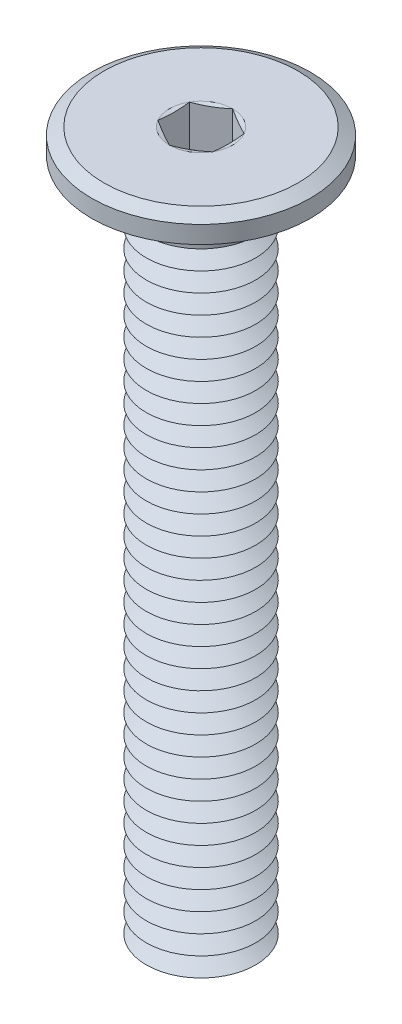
ISO-10303-21;
HEADER;
FILE_DESCRIPTION(('STEP AP214'),'2;1');
FILE_NAME('part.step','',(''),(''),'','','');
FILE_SCHEMA(('AUTOMOTIVE_DESIGN { 1 0 10303 214 1 1 1 1 }'));
ENDSEC;
DATA;
#1=APPLICATION_CONTEXT('core data for automotive mechanical design processes');
#2=APPLICATION_PROTOCOL_DEFINITION('international standard','automotive_design',2000,#1);
#3=PRODUCT_CONTEXT('',#1,'mechanical');
#4=PRODUCT('Part','Part','',(#3));
#5=PRODUCT_RELATED_PRODUCT_CATEGORY('part','',(#4));
#6=PRODUCT_DEFINITION_FORMATION('','',#4);
#7=PRODUCT_DEFINITION_CONTEXT('part definition',#1,'design');
#8=PRODUCT_DEFINITION('design','',#6,#7);
#9=PRODUCT_DEFINITION_SHAPE('','',#8);
#10=(LENGTH_UNIT() NAMED_UNIT(*) SI_UNIT(.MILLI.,.METRE.));
#11=(NAMED_UNIT(*) PLANE_ANGLE_UNIT() SI_UNIT($,.RADIAN.));
#12=(NAMED_UNIT(*) SI_UNIT($,.STERADIAN.) SOLID_ANGLE_UNIT());
#13=UNCERTAINTY_MEASURE_WITH_UNIT(LENGTH_MEASURE(1.E-05),#10,'distance_accuracy_value','');
#14=(GEOMETRIC_REPRESENTATION_CONTEXT(3) GLOBAL_UNCERTAINTY_ASSIGNED_CONTEXT((#13)) GLOBAL_UNIT_ASSIGNED_CONTEXT((#10,
#11,#12)) REPRESENTATION_CONTEXT('',''));
#15=CARTESIAN_POINT('',(0.,0.,0.));
#16=DIRECTION('',(0.,0.,1.));
#17=DIRECTION('',(1.,0.,0.));
#18=AXIS2_PLACEMENT_3D('',#15,#16,#17);
#19=CARTESIAN_POINT('',(0.,-24.85,0.));
#20=DIRECTION('',(0.,-1.,0.));
#21=DIRECTION('',(0.,0.,-1.));
#22=AXIS2_PLACEMENT_3D('',#19,#20,#21);
#23=CONICAL_SURFACE('',#22,2.,1.0471975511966);
#24=CARTESIAN_POINT('',(0.,-24.5,0.));
#25=DIRECTION('',(0.,1.,0.));
#26=DIRECTION('',(0.,0.,1.));
#27=AXIS2_PLACEMENT_3D('',#24,#25,#26);
#28=CIRCLE('',#27,1.39378221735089);
#29=CARTESIAN_POINT('',(0.,-24.5,1.39378221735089));
#30=VERTEX_POINT('',#29);
#31=EDGE_CURVE('E628',#30,#30,#28,.T.);
#32=ORIENTED_EDGE('',*,*,#31,.F.);
#33=EDGE_LOOP('',(#32));
#34=FACE_BOUND('',#33,.T.);
#35=CARTESIAN_POINT('',(0.,-24.85,0.));
#36=DIRECTION('',(0.,1.,0.));
#37=DIRECTION('',(0.,0.,1.));
#38=AXIS2_PLACEMENT_3D('',#35,#36,#37);
#39=CIRCLE('',#38,2.);
#40=CARTESIAN_POINT('',(0.,-24.85,2.));
#41=VERTEX_POINT('',#40);
#42=EDGE_CURVE('E631',#41,#41,#39,.T.);
#43=ORIENTED_EDGE('',*,*,#42,.T.);
#44=EDGE_LOOP('',(#43));
#45=FACE_BOUND('',#44,.T.);
#46=ADVANCED_FACE('F39',(#34,#45),#23,.T.);
#47=CARTESIAN_POINT('',(0.,-24.5,0.));
#48=DIRECTION('',(0.,1.,0.));
#49=DIRECTION('',(0.,0.,1.));
#50=AXIS2_PLACEMENT_3D('',#47,#48,#49);
#51=CONICAL_SURFACE('',#50,1.39378221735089,1.0471975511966);
#52=CARTESIAN_POINT('',(0.,-24.15,0.));
#53=DIRECTION('',(0.,1.,0.));
#54=DIRECTION('',(0.,0.,1.));
#55=AXIS2_PLACEMENT_3D('',#52,#53,#54);
#56=CIRCLE('',#55,2.);
#57=CARTESIAN_POINT('',(0.,-24.15,2.));
#58=VERTEX_POINT('',#57);
#59=EDGE_CURVE('E624',#58,#58,#56,.T.);
#60=ORIENTED_EDGE('',*,*,#59,.F.);
#61=EDGE_LOOP('',(#60));
#62=FACE_BOUND('',#61,.T.);
#63=ORIENTED_EDGE('',*,*,#31,.T.);
#64=EDGE_LOOP('',(#63));
#65=FACE_BOUND('',#64,.T.);
#66=ADVANCED_FACE('F233',(#62,#65),#51,.T.);
#67=CARTESIAN_POINT('',(0.,-25.9,0.));
#68=DIRECTION('',(0.,-1.,0.));
#69=DIRECTION('',(0.,0.,-1.));
#70=AXIS2_PLACEMENT_3D('',#67,#68,#69);
#71=PLANE('',#70);
#72=CARTESIAN_POINT('',(0.,-25.9,0.));
#73=DIRECTION('',(0.,1.,0.));
#74=DIRECTION('',(0.,0.,1.));
#75=AXIS2_PLACEMENT_3D('',#72,#73,#74);
#76=CIRCLE('',#75,1.39378221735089);
#77=CARTESIAN_POINT('',(0.,-25.9,1.39378221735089));
#78=VERTEX_POINT('',#77);
#79=EDGE_CURVE('E299',#78,#78,#76,.T.);
#80=ORIENTED_EDGE('',*,*,#79,.F.);
#81=EDGE_LOOP('',(#80));
#82=FACE_BOUND('',#81,.T.);
#83=ADVANCED_FACE('F239',(#82),#71,.T.);
#84=CARTESIAN_POINT('',(0.,-25.9,0.));
#85=DIRECTION('',(0.,1.,0.));
#86=DIRECTION('',(0.,0.,1.));
#87=AXIS2_PLACEMENT_3D('',#84,#85,#86);
#88=CONICAL_SURFACE('',#87,1.39378221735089,1.0471975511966);
#89=CARTESIAN_POINT('',(0.,-25.55,0.));
#90=DIRECTION('',(0.,1.,0.));
#91=DIRECTION('',(0.,0.,1.));
#92=AXIS2_PLACEMENT_3D('',#89,#90,#91);
#93=CIRCLE('',#92,2.);
#94=CARTESIAN_POINT('',(0.,-25.55,2.));
#95=VERTEX_POINT('',#94);
#96=EDGE_CURVE('E638',#95,#95,#93,.T.);
#97=ORIENTED_EDGE('',*,*,#96,.F.);
#98=EDGE_LOOP('',(#97));
#99=FACE_BOUND('',#98,.T.);
#100=ORIENTED_EDGE('',*,*,#79,.T.);
#101=EDGE_LOOP('',(#100));
#102=FACE_BOUND('',#101,.T.);
#103=ADVANCED_FACE('F254',(#99,#102),#88,.T.);
#104=CARTESIAN_POINT('',(0.,-25.55,0.));
#105=DIRECTION('',(0.,-1.,0.));
#106=DIRECTION('',(0.,0.,-1.));
#107=AXIS2_PLACEMENT_3D('',#104,#105,#106);
#108=CONICAL_SURFACE('',#107,2.,1.0471975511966);
#109=CARTESIAN_POINT('',(0.,-25.2,0.));
#110=DIRECTION('',(0.,1.,0.));
#111=DIRECTION('',(0.,0.,1.));
#112=AXIS2_PLACEMENT_3D('',#109,#110,#111);
#113=CIRCLE('',#112,1.39378221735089);
#114=CARTESIAN_POINT('',(0.,-25.2,1.39378221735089));
#115=VERTEX_POINT('',#114);
#116=EDGE_CURVE('E634',#115,#115,#113,.T.);
#117=ORIENTED_EDGE('',*,*,#116,.F.);
#118=EDGE_LOOP('',(#117));
#119=FACE_BOUND('',#118,.T.);
#120=ORIENTED_EDGE('',*,*,#96,.T.);
#121=EDGE_LOOP('',(#120));
#122=FACE_BOUND('',#121,.T.);
#123=ADVANCED_FACE('F250',(#119,#122),#108,.T.);
#124=CARTESIAN_POINT('',(0.,-25.2,0.));
#125=DIRECTION('',(0.,1.,0.));
#126=DIRECTION('',(0.,0.,1.));
#127=AXIS2_PLACEMENT_3D('',#124,#125,#126);
#128=CONICAL_SURFACE('',#127,1.39378221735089,1.0471975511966);
#129=ORIENTED_EDGE('',*,*,#42,.F.);
#130=EDGE_LOOP('',(#129));
#131=FACE_BOUND('',#130,.T.);
#132=ORIENTED_EDGE('',*,*,#116,.T.);
#133=EDGE_LOOP('',(#132));
#134=FACE_BOUND('',#133,.T.);
#135=ADVANCED_FACE('F246',(#131,#134),#128,.T.);
#136=CARTESIAN_POINT('',(0.,-24.15,0.));
#137=DIRECTION('',(0.,-1.,0.));
#138=DIRECTION('',(0.,0.,-1.));
#139=AXIS2_PLACEMENT_3D('',#136,#137,#138);
#140=CONICAL_SURFACE('',#139,2.,1.0471975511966);
#141=CARTESIAN_POINT('',(0.,-23.8,0.));
#142=DIRECTION('',(0.,1.,0.));
#143=DIRECTION('',(0.,0.,1.));
#144=AXIS2_PLACEMENT_3D('',#141,#142,#143);
#145=CIRCLE('',#144,1.39378221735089);
#146=CARTESIAN_POINT('',(0.,-23.8,1.39378221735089));
#147=VERTEX_POINT('',#146);
#148=EDGE_CURVE('E620',#147,#147,#145,.T.);
#149=ORIENTED_EDGE('',*,*,#148,.F.);
#150=EDGE_LOOP('',(#149));
#151=FACE_BOUND('',#150,.T.);
#152=ORIENTED_EDGE('',*,*,#59,.T.);
#153=EDGE_LOOP('',(#152));
#154=FACE_BOUND('',#153,.T.);
#155=ADVANCED_FACE('F249',(#151,#154),#140,.T.);
#156=CARTESIAN_POINT('',(0.,-23.8,0.));
#157=DIRECTION('',(0.,1.,0.));
#158=DIRECTION('',(0.,0.,1.));
#159=AXIS2_PLACEMENT_3D('',#156,#157,#158);
#160=CONICAL_SURFACE('',#159,1.39378221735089,1.0471975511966);
#161=CARTESIAN_POINT('',(0.,-23.45,0.));
#162=DIRECTION('',(0.,1.,0.));
#163=DIRECTION('',(0.,0.,1.));
#164=AXIS2_PLACEMENT_3D('',#161,#162,#163);
#165=CIRCLE('',#164,2.);
#166=CARTESIAN_POINT('',(0.,-23.45,2.));
#167=VERTEX_POINT('',#166);
#168=EDGE_CURVE('E616',#167,#167,#165,.T.);
#169=ORIENTED_EDGE('',*,*,#168,.F.);
#170=EDGE_LOOP('',(#169));
#171=FACE_BOUND('',#170,.T.);
#172=ORIENTED_EDGE('',*,*,#148,.T.);
#173=EDGE_LOOP('',(#172));
#174=FACE_BOUND('',#173,.T.);
#175=ADVANCED_FACE('F1276',(#171,#174),#160,.T.);
#176=CARTESIAN_POINT('',(0.,-23.45,0.));
#177=DIRECTION('',(0.,-1.,0.));
#178=DIRECTION('',(0.,0.,-1.));
#179=AXIS2_PLACEMENT_3D('',#176,#177,#178);
#180=CONICAL_SURFACE('',#179,2.,1.0471975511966);
#181=CARTESIAN_POINT('',(0.,-23.1,0.));
#182=DIRECTION('',(0.,1.,0.));
#183=DIRECTION('',(0.,0.,1.));
#184=AXIS2_PLACEMENT_3D('',#181,#182,#183);
#185=CIRCLE('',#184,1.39378221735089);
#186=CARTESIAN_POINT('',(0.,-23.1,1.39378221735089));
#187=VERTEX_POINT('',#186);
#188=EDGE_CURVE('E613',#187,#187,#185,.T.);
#189=ORIENTED_EDGE('',*,*,#188,.F.);
#190=EDGE_LOOP('',(#189));
#191=FACE_BOUND('',#190,.T.);
#192=ORIENTED_EDGE('',*,*,#168,.T.);
#193=EDGE_LOOP('',(#192));
#194=FACE_BOUND('',#193,.T.);
#195=ADVANCED_FACE('F1267',(#191,#194),#180,.T.);
#196=CARTESIAN_POINT('',(0.,-23.1,0.));
#197=DIRECTION('',(0.,1.,0.));
#198=DIRECTION('',(0.,0.,1.));
#199=AXIS2_PLACEMENT_3D('',#196,#197,#198);
#200=CONICAL_SURFACE('',#199,1.39378221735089,1.0471975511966);
#201=CARTESIAN_POINT('',(0.,-22.75,0.));
#202=DIRECTION('',(0.,1.,0.));
#203=DIRECTION('',(0.,0.,1.));
#204=AXIS2_PLACEMENT_3D('',#201,#202,#203);
#205=CIRCLE('',#204,2.);
#206=CARTESIAN_POINT('',(0.,-22.75,2.));
#207=VERTEX_POINT('',#206);
#208=EDGE_CURVE('E609',#207,#207,#205,.T.);
#209=ORIENTED_EDGE('',*,*,#208,.F.);
#210=EDGE_LOOP('',(#209));
#211=FACE_BOUND('',#210,.T.);
#212=ORIENTED_EDGE('',*,*,#188,.T.);
#213=EDGE_LOOP('',(#212));
#214=FACE_BOUND('',#213,.T.);
#215=ADVANCED_FACE('F1258',(#211,#214),#200,.T.);
#216=CARTESIAN_POINT('',(0.,-22.75,0.));
#217=DIRECTION('',(0.,-1.,0.));
#218=DIRECTION('',(0.,0.,-1.));
#219=AXIS2_PLACEMENT_3D('',#216,#217,#218);
#220=CONICAL_SURFACE('',#219,2.,1.0471975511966);
#221=CARTESIAN_POINT('',(0.,-22.4,0.));
#222=DIRECTION('',(0.,1.,0.));
#223=DIRECTION('',(0.,0.,1.));
#224=AXIS2_PLACEMENT_3D('',#221,#222,#223);
#225=CIRCLE('',#224,1.39378221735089);
#226=CARTESIAN_POINT('',(0.,-22.4,1.39378221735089));
#227=VERTEX_POINT('',#226);
#228=EDGE_CURVE('E605',#227,#227,#225,.T.);
#229=ORIENTED_EDGE('',*,*,#228,.F.);
#230=EDGE_LOOP('',(#229));
#231=FACE_BOUND('',#230,.T.);
#232=ORIENTED_EDGE('',*,*,#208,.T.);
#233=EDGE_LOOP('',(#232));
#234=FACE_BOUND('',#233,.T.);
#235=ADVANCED_FACE('F1249',(#231,#234),#220,.T.);
#236=CARTESIAN_POINT('',(0.,-22.4,0.));
#237=DIRECTION('',(0.,1.,0.));
#238=DIRECTION('',(0.,0.,1.));
#239=AXIS2_PLACEMENT_3D('',#236,#237,#238);
#240=CONICAL_SURFACE('',#239,1.39378221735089,1.0471975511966);
#241=CARTESIAN_POINT('',(0.,-22.05,0.));
#242=DIRECTION('',(0.,1.,0.));
#243=DIRECTION('',(0.,0.,1.));
#244=AXIS2_PLACEMENT_3D('',#241,#242,#243);
#245=CIRCLE('',#244,2.);
#246=CARTESIAN_POINT('',(0.,-22.05,2.));
#247=VERTEX_POINT('',#246);
#248=EDGE_CURVE('E601',#247,#247,#245,.T.);
#249=ORIENTED_EDGE('',*,*,#248,.F.);
#250=EDGE_LOOP('',(#249));
#251=FACE_BOUND('',#250,.T.);
#252=ORIENTED_EDGE('',*,*,#228,.T.);
#253=EDGE_LOOP('',(#252));
#254=FACE_BOUND('',#253,.T.);
#255=ADVANCED_FACE('F1240',(#251,#254),#240,.T.);
#256=CARTESIAN_POINT('',(0.,-22.05,0.));
#257=DIRECTION('',(0.,-1.,0.));
#258=DIRECTION('',(0.,0.,-1.));
#259=AXIS2_PLACEMENT_3D('',#256,#257,#258);
#260=CONICAL_SURFACE('',#259,2.,1.0471975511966);
#261=CARTESIAN_POINT('',(0.,-21.7,0.));
#262=DIRECTION('',(0.,1.,0.));
#263=DIRECTION('',(0.,0.,1.));
#264=AXIS2_PLACEMENT_3D('',#261,#262,#263);
#265=CIRCLE('',#264,1.39378221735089);
#266=CARTESIAN_POINT('',(0.,-21.7,1.39378221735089));
#267=VERTEX_POINT('',#266);
#268=EDGE_CURVE('E597',#267,#267,#265,.T.);
#269=ORIENTED_EDGE('',*,*,#268,.F.);
#270=EDGE_LOOP('',(#269));
#271=FACE_BOUND('',#270,.T.);
#272=ORIENTED_EDGE('',*,*,#248,.T.);
#273=EDGE_LOOP('',(#272));
#274=FACE_BOUND('',#273,.T.);
#275=ADVANCED_FACE('F1231',(#271,#274),#260,.T.);
#276=CARTESIAN_POINT('',(0.,-21.7,0.));
#277=DIRECTION('',(0.,1.,0.));
#278=DIRECTION('',(0.,0.,1.));
#279=AXIS2_PLACEMENT_3D('',#276,#277,#278);
#280=CONICAL_SURFACE('',#279,1.39378221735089,1.0471975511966);
#281=CARTESIAN_POINT('',(0.,-21.35,0.));
#282=DIRECTION('',(0.,1.,0.));
#283=DIRECTION('',(0.,0.,1.));
#284=AXIS2_PLACEMENT_3D('',#281,#282,#283);
#285=CIRCLE('',#284,2.);
#286=CARTESIAN_POINT('',(0.,-21.35,2.));
#287=VERTEX_POINT('',#286);
#288=EDGE_CURVE('E593',#287,#287,#285,.T.);
#289=ORIENTED_EDGE('',*,*,#288,.F.);
#290=EDGE_LOOP('',(#289));
#291=FACE_BOUND('',#290,.T.);
#292=ORIENTED_EDGE('',*,*,#268,.T.);
#293=EDGE_LOOP('',(#292));
#294=FACE_BOUND('',#293,.T.);
#295=ADVANCED_FACE('F1222',(#291,#294),#280,.T.);
#296=CARTESIAN_POINT('',(0.,-21.35,0.));
#297=DIRECTION('',(0.,-1.,0.));
#298=DIRECTION('',(0.,0.,-1.));
#299=AXIS2_PLACEMENT_3D('',#296,#297,#298);
#300=CONICAL_SURFACE('',#299,2.,1.0471975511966);
#301=CARTESIAN_POINT('',(0.,-21.,0.));
#302=DIRECTION('',(0.,1.,0.));
#303=DIRECTION('',(0.,0.,1.));
#304=AXIS2_PLACEMENT_3D('',#301,#302,#303);
#305=CIRCLE('',#304,1.39378221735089);
#306=CARTESIAN_POINT('',(0.,-21.,1.39378221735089));
#307=VERTEX_POINT('',#306);
#308=EDGE_CURVE('E589',#307,#307,#305,.T.);
#309=ORIENTED_EDGE('',*,*,#308,.F.);
#310=EDGE_LOOP('',(#309));
#311=FACE_BOUND('',#310,.T.);
#312=ORIENTED_EDGE('',*,*,#288,.T.);
#313=EDGE_LOOP('',(#312));
#314=FACE_BOUND('',#313,.T.);
#315=ADVANCED_FACE('F1213',(#311,#314),#300,.T.);
#316=CARTESIAN_POINT('',(0.,-21.,0.));
#317=DIRECTION('',(0.,1.,0.));
#318=DIRECTION('',(0.,0.,1.));
#319=AXIS2_PLACEMENT_3D('',#316,#317,#318);
#320=CONICAL_SURFACE('',#319,1.39378221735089,1.0471975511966);
#321=CARTESIAN_POINT('',(0.,-20.65,0.));
#322=DIRECTION('',(0.,1.,0.));
#323=DIRECTION('',(0.,0.,1.));
#324=AXIS2_PLACEMENT_3D('',#321,#322,#323);
#325=CIRCLE('',#324,2.);
#326=CARTESIAN_POINT('',(0.,-20.65,2.));
#327=VERTEX_POINT('',#326);
#328=EDGE_CURVE('E585',#327,#327,#325,.T.);
#329=ORIENTED_EDGE('',*,*,#328,.F.);
#330=EDGE_LOOP('',(#329));
#331=FACE_BOUND('',#330,.T.);
#332=ORIENTED_EDGE('',*,*,#308,.T.);
#333=EDGE_LOOP('',(#332));
#334=FACE_BOUND('',#333,.T.);
#335=ADVANCED_FACE('F1204',(#331,#334),#320,.T.);
#336=CARTESIAN_POINT('',(0.,-20.65,0.));
#337=DIRECTION('',(0.,-1.,0.));
#338=DIRECTION('',(0.,0.,-1.));
#339=AXIS2_PLACEMENT_3D('',#336,#337,#338);
#340=CONICAL_SURFACE('',#339,2.,1.0471975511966);
#341=CARTESIAN_POINT('',(0.,-20.3,0.));
#342=DIRECTION('',(0.,1.,0.));
#343=DIRECTION('',(0.,0.,1.));
#344=AXIS2_PLACEMENT_3D('',#341,#342,#343);
#345=CIRCLE('',#344,1.39378221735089);
#346=CARTESIAN_POINT('',(0.,-20.3,1.39378221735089));
#347=VERTEX_POINT('',#346);
#348=EDGE_CURVE('E581',#347,#347,#345,.T.);
#349=ORIENTED_EDGE('',*,*,#348,.F.);
#350=EDGE_LOOP('',(#349));
#351=FACE_BOUND('',#350,.T.);
#352=ORIENTED_EDGE('',*,*,#328,.T.);
#353=EDGE_LOOP('',(#352));
#354=FACE_BOUND('',#353,.T.);
#355=ADVANCED_FACE('F1195',(#351,#354),#340,.T.);
#356=CARTESIAN_POINT('',(0.,-20.3,0.));
#357=DIRECTION('',(0.,1.,0.));
#358=DIRECTION('',(0.,0.,1.));
#359=AXIS2_PLACEMENT_3D('',#356,#357,#358);
#360=CONICAL_SURFACE('',#359,1.39378221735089,1.0471975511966);
#361=CARTESIAN_POINT('',(0.,-19.95,0.));
#362=DIRECTION('',(0.,1.,0.));
#363=DIRECTION('',(0.,0.,1.));
#364=AXIS2_PLACEMENT_3D('',#361,#362,#363);
#365=CIRCLE('',#364,2.);
#366=CARTESIAN_POINT('',(0.,-19.95,2.));
#367=VERTEX_POINT('',#366);
#368=EDGE_CURVE('E577',#367,#367,#365,.T.);
#369=ORIENTED_EDGE('',*,*,#368,.F.);
#370=EDGE_LOOP('',(#369));
#371=FACE_BOUND('',#370,.T.);
#372=ORIENTED_EDGE('',*,*,#348,.T.);
#373=EDGE_LOOP('',(#372));
#374=FACE_BOUND('',#373,.T.);
#375=ADVANCED_FACE('F1186',(#371,#374),#360,.T.);
#376=CARTESIAN_POINT('',(0.,-19.95,0.));
#377=DIRECTION('',(0.,-1.,0.));
#378=DIRECTION('',(0.,0.,-1.));
#379=AXIS2_PLACEMENT_3D('',#376,#377,#378);
#380=CONICAL_SURFACE('',#379,2.,1.0471975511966);
#381=CARTESIAN_POINT('',(0.,-19.6,0.));
#382=DIRECTION('',(0.,1.,0.));
#383=DIRECTION('',(0.,0.,1.));
#384=AXIS2_PLACEMENT_3D('',#381,#382,#383);
#385=CIRCLE('',#384,1.39378221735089);
#386=CARTESIAN_POINT('',(0.,-19.6,1.39378221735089));
#387=VERTEX_POINT('',#386);
#388=EDGE_CURVE('E573',#387,#387,#385,.T.);
#389=ORIENTED_EDGE('',*,*,#388,.F.);
#390=EDGE_LOOP('',(#389));
#391=FACE_BOUND('',#390,.T.);
#392=ORIENTED_EDGE('',*,*,#368,.T.);
#393=EDGE_LOOP('',(#392));
#394=FACE_BOUND('',#393,.T.);
#395=ADVANCED_FACE('F1177',(#391,#394),#380,.T.);
#396=CARTESIAN_POINT('',(0.,-19.6,0.));
#397=DIRECTION('',(0.,1.,0.));
#398=DIRECTION('',(0.,0.,1.));
#399=AXIS2_PLACEMENT_3D('',#396,#397,#398);
#400=CONICAL_SURFACE('',#399,1.39378221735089,1.0471975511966);
#401=CARTESIAN_POINT('',(0.,-19.25,0.));
#402=DIRECTION('',(0.,1.,0.));
#403=DIRECTION('',(0.,0.,1.));
#404=AXIS2_PLACEMENT_3D('',#401,#402,#403);
#405=CIRCLE('',#404,2.);
#406=CARTESIAN_POINT('',(0.,-19.25,2.));
#407=VERTEX_POINT('',#406);
#408=EDGE_CURVE('E569',#407,#407,#405,.T.);
#409=ORIENTED_EDGE('',*,*,#408,.F.);
#410=EDGE_LOOP('',(#409));
#411=FACE_BOUND('',#410,.T.);
#412=ORIENTED_EDGE('',*,*,#388,.T.);
#413=EDGE_LOOP('',(#412));
#414=FACE_BOUND('',#413,.T.);
#415=ADVANCED_FACE('F1168',(#411,#414),#400,.T.);
#416=CARTESIAN_POINT('',(0.,-19.25,0.));
#417=DIRECTION('',(0.,-1.,0.));
#418=DIRECTION('',(0.,0.,-1.));
#419=AXIS2_PLACEMENT_3D('',#416,#417,#418);
#420=CONICAL_SURFACE('',#419,2.,1.0471975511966);
#421=CARTESIAN_POINT('',(0.,-18.9,0.));
#422=DIRECTION('',(0.,1.,0.));
#423=DIRECTION('',(0.,0.,1.));
#424=AXIS2_PLACEMENT_3D('',#421,#422,#423);
#425=CIRCLE('',#424,1.39378221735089);
#426=CARTESIAN_POINT('',(0.,-18.9,1.39378221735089));
#427=VERTEX_POINT('',#426);
#428=EDGE_CURVE('E565',#427,#427,#425,.T.);
#429=ORIENTED_EDGE('',*,*,#428,.F.);
#430=EDGE_LOOP('',(#429));
#431=FACE_BOUND('',#430,.T.);
#432=ORIENTED_EDGE('',*,*,#408,.T.);
#433=EDGE_LOOP('',(#432));
#434=FACE_BOUND('',#433,.T.);
#435=ADVANCED_FACE('F1159',(#431,#434),#420,.T.);
#436=CARTESIAN_POINT('',(0.,-18.9,0.));
#437=DIRECTION('',(0.,1.,0.));
#438=DIRECTION('',(0.,0.,1.));
#439=AXIS2_PLACEMENT_3D('',#436,#437,#438);
#440=CONICAL_SURFACE('',#439,1.39378221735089,1.0471975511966);
#441=CARTESIAN_POINT('',(0.,-18.55,0.));
#442=DIRECTION('',(0.,1.,0.));
#443=DIRECTION('',(0.,0.,1.));
#444=AXIS2_PLACEMENT_3D('',#441,#442,#443);
#445=CIRCLE('',#444,2.);
#446=CARTESIAN_POINT('',(0.,-18.55,2.));
#447=VERTEX_POINT('',#446);
#448=EDGE_CURVE('E561',#447,#447,#445,.T.);
#449=ORIENTED_EDGE('',*,*,#448,.F.);
#450=EDGE_LOOP('',(#449));
#451=FACE_BOUND('',#450,.T.);
#452=ORIENTED_EDGE('',*,*,#428,.T.);
#453=EDGE_LOOP('',(#452));
#454=FACE_BOUND('',#453,.T.);
#455=ADVANCED_FACE('F1150',(#451,#454),#440,.T.);
#456=CARTESIAN_POINT('',(0.,-18.55,0.));
#457=DIRECTION('',(0.,-1.,0.));
#458=DIRECTION('',(0.,0.,-1.));
#459=AXIS2_PLACEMENT_3D('',#456,#457,#458);
#460=CONICAL_SURFACE('',#459,2.,1.0471975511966);
#461=CARTESIAN_POINT('',(0.,-18.2,0.));
#462=DIRECTION('',(0.,1.,0.));
#463=DIRECTION('',(0.,0.,1.));
#464=AXIS2_PLACEMENT_3D('',#461,#462,#463);
#465=CIRCLE('',#464,1.39378221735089);
#466=CARTESIAN_POINT('',(0.,-18.2,1.39378221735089));
#467=VERTEX_POINT('',#466);
#468=EDGE_CURVE('E557',#467,#467,#465,.T.);
#469=ORIENTED_EDGE('',*,*,#468,.F.);
#470=EDGE_LOOP('',(#469));
#471=FACE_BOUND('',#470,.T.);
#472=ORIENTED_EDGE('',*,*,#448,.T.);
#473=EDGE_LOOP('',(#472));
#474=FACE_BOUND('',#473,.T.);
#475=ADVANCED_FACE('F1141',(#471,#474),#460,.T.);
#476=CARTESIAN_POINT('',(0.,-18.2,0.));
#477=DIRECTION('',(0.,1.,0.));
#478=DIRECTION('',(0.,0.,1.));
#479=AXIS2_PLACEMENT_3D('',#476,#477,#478);
#480=CONICAL_SURFACE('',#479,1.39378221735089,1.0471975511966);
#481=CARTESIAN_POINT('',(0.,-17.85,0.));
#482=DIRECTION('',(0.,1.,0.));
#483=DIRECTION('',(0.,0.,1.));
#484=AXIS2_PLACEMENT_3D('',#481,#482,#483);
#485=CIRCLE('',#484,2.);
#486=CARTESIAN_POINT('',(0.,-17.85,2.));
#487=VERTEX_POINT('',#486);
#488=EDGE_CURVE('E553',#487,#487,#485,.T.);
#489=ORIENTED_EDGE('',*,*,#488,.F.);
#490=EDGE_LOOP('',(#489));
#491=FACE_BOUND('',#490,.T.);
#492=ORIENTED_EDGE('',*,*,#468,.T.);
#493=EDGE_LOOP('',(#492));
#494=FACE_BOUND('',#493,.T.);
#495=ADVANCED_FACE('F1132',(#491,#494),#480,.T.);
#496=CARTESIAN_POINT('',(0.,-17.85,0.));
#497=DIRECTION('',(0.,-1.,0.));
#498=DIRECTION('',(0.,0.,-1.));
#499=AXIS2_PLACEMENT_3D('',#496,#497,#498);
#500=CONICAL_SURFACE('',#499,2.,1.0471975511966);
#501=CARTESIAN_POINT('',(0.,-17.5,0.));
#502=DIRECTION('',(0.,1.,0.));
#503=DIRECTION('',(0.,0.,1.));
#504=AXIS2_PLACEMENT_3D('',#501,#502,#503);
#505=CIRCLE('',#504,1.39378221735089);
#506=CARTESIAN_POINT('',(0.,-17.5,1.39378221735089));
#507=VERTEX_POINT('',#506);
#508=EDGE_CURVE('E549',#507,#507,#505,.T.);
#509=ORIENTED_EDGE('',*,*,#508,.F.);
#510=EDGE_LOOP('',(#509));
#511=FACE_BOUND('',#510,.T.);
#512=ORIENTED_EDGE('',*,*,#488,.T.);
#513=EDGE_LOOP('',(#512));
#514=FACE_BOUND('',#513,.T.);
#515=ADVANCED_FACE('F1123',(#511,#514),#500,.T.);
#516=CARTESIAN_POINT('',(0.,-17.5,0.));
#517=DIRECTION('',(0.,1.,0.));
#518=DIRECTION('',(0.,0.,1.));
#519=AXIS2_PLACEMENT_3D('',#516,#517,#518);
#520=CONICAL_SURFACE('',#519,1.39378221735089,1.0471975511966);
#521=CARTESIAN_POINT('',(0.,-17.15,0.));
#522=DIRECTION('',(0.,1.,0.));
#523=DIRECTION('',(0.,0.,1.));
#524=AXIS2_PLACEMENT_3D('',#521,#522,#523);
#525=CIRCLE('',#524,2.);
#526=CARTESIAN_POINT('',(0.,-17.15,2.));
#527=VERTEX_POINT('',#526);
#528=EDGE_CURVE('E545',#527,#527,#525,.T.);
#529=ORIENTED_EDGE('',*,*,#528,.F.);
#530=EDGE_LOOP('',(#529));
#531=FACE_BOUND('',#530,.T.);
#532=ORIENTED_EDGE('',*,*,#508,.T.);
#533=EDGE_LOOP('',(#532));
#534=FACE_BOUND('',#533,.T.);
#535=ADVANCED_FACE('F1114',(#531,#534),#520,.T.);
#536=CARTESIAN_POINT('',(0.,-17.15,0.));
#537=DIRECTION('',(0.,-1.,0.));
#538=DIRECTION('',(0.,0.,-1.));
#539=AXIS2_PLACEMENT_3D('',#536,#537,#538);
#540=CONICAL_SURFACE('',#539,2.,1.0471975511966);
#541=CARTESIAN_POINT('',(0.,-16.8,0.));
#542=DIRECTION('',(0.,1.,0.));
#543=DIRECTION('',(0.,0.,1.));
#544=AXIS2_PLACEMENT_3D('',#541,#542,#543);
#545=CIRCLE('',#544,1.39378221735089);
#546=CARTESIAN_POINT('',(0.,-16.8,1.39378221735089));
#547=VERTEX_POINT('',#546);
#548=EDGE_CURVE('E541',#547,#547,#545,.T.);
#549=ORIENTED_EDGE('',*,*,#548,.F.);
#550=EDGE_LOOP('',(#549));
#551=FACE_BOUND('',#550,.T.);
#552=ORIENTED_EDGE('',*,*,#528,.T.);
#553=EDGE_LOOP('',(#552));
#554=FACE_BOUND('',#553,.T.);
#555=ADVANCED_FACE('F1105',(#551,#554),#540,.T.);
#556=CARTESIAN_POINT('',(0.,-16.8,0.));
#557=DIRECTION('',(0.,1.,0.));
#558=DIRECTION('',(0.,0.,1.));
#559=AXIS2_PLACEMENT_3D('',#556,#557,#558);
#560=CONICAL_SURFACE('',#559,1.39378221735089,1.0471975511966);
#561=CARTESIAN_POINT('',(0.,-16.45,0.));
#562=DIRECTION('',(0.,1.,0.));
#563=DIRECTION('',(0.,0.,1.));
#564=AXIS2_PLACEMENT_3D('',#561,#562,#563);
#565=CIRCLE('',#564,2.);
#566=CARTESIAN_POINT('',(0.,-16.45,2.));
#567=VERTEX_POINT('',#566);
#568=EDGE_CURVE('E537',#567,#567,#565,.T.);
#569=ORIENTED_EDGE('',*,*,#568,.F.);
#570=EDGE_LOOP('',(#569));
#571=FACE_BOUND('',#570,.T.);
#572=ORIENTED_EDGE('',*,*,#548,.T.);
#573=EDGE_LOOP('',(#572));
#574=FACE_BOUND('',#573,.T.);
#575=ADVANCED_FACE('F1096',(#571,#574),#560,.T.);
#576=CARTESIAN_POINT('',(0.,-16.45,0.));
#577=DIRECTION('',(0.,-1.,0.));
#578=DIRECTION('',(0.,0.,-1.));
#579=AXIS2_PLACEMENT_3D('',#576,#577,#578);
#580=CONICAL_SURFACE('',#579,2.,1.0471975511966);
#581=CARTESIAN_POINT('',(0.,-16.1,0.));
#582=DIRECTION('',(0.,1.,0.));
#583=DIRECTION('',(0.,0.,1.));
#584=AXIS2_PLACEMENT_3D('',#581,#582,#583);
#585=CIRCLE('',#584,1.39378221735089);
#586=CARTESIAN_POINT('',(0.,-16.1,1.39378221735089));
#587=VERTEX_POINT('',#586);
#588=EDGE_CURVE('E533',#587,#587,#585,.T.);
#589=ORIENTED_EDGE('',*,*,#588,.F.);
#590=EDGE_LOOP('',(#589));
#591=FACE_BOUND('',#590,.T.);
#592=ORIENTED_EDGE('',*,*,#568,.T.);
#593=EDGE_LOOP('',(#592));
#594=FACE_BOUND('',#593,.T.);
#595=ADVANCED_FACE('F1087',(#591,#594),#580,.T.);
#596=CARTESIAN_POINT('',(0.,-16.1,0.));
#597=DIRECTION('',(0.,1.,0.));
#598=DIRECTION('',(0.,0.,1.));
#599=AXIS2_PLACEMENT_3D('',#596,#597,#598);
#600=CONICAL_SURFACE('',#599,1.39378221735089,1.0471975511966);
#601=CARTESIAN_POINT('',(0.,-15.75,0.));
#602=DIRECTION('',(0.,1.,0.));
#603=DIRECTION('',(0.,0.,1.));
#604=AXIS2_PLACEMENT_3D('',#601,#602,#603);
#605=CIRCLE('',#604,2.);
#606=CARTESIAN_POINT('',(0.,-15.75,2.));
#607=VERTEX_POINT('',#606);
#608=EDGE_CURVE('E529',#607,#607,#605,.T.);
#609=ORIENTED_EDGE('',*,*,#608,.F.);
#610=EDGE_LOOP('',(#609));
#611=FACE_BOUND('',#610,.T.);
#612=ORIENTED_EDGE('',*,*,#588,.T.);
#613=EDGE_LOOP('',(#612));
#614=FACE_BOUND('',#613,.T.);
#615=ADVANCED_FACE('F1078',(#611,#614),#600,.T.);
#616=CARTESIAN_POINT('',(0.,-15.75,0.));
#617=DIRECTION('',(0.,-1.,0.));
#618=DIRECTION('',(0.,0.,-1.));
#619=AXIS2_PLACEMENT_3D('',#616,#617,#618);
#620=CONICAL_SURFACE('',#619,2.,1.0471975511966);
#621=CARTESIAN_POINT('',(0.,-15.4,0.));
#622=DIRECTION('',(0.,1.,0.));
#623=DIRECTION('',(0.,0.,1.));
#624=AXIS2_PLACEMENT_3D('',#621,#622,#623);
#625=CIRCLE('',#624,1.39378221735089);
#626=CARTESIAN_POINT('',(0.,-15.4,1.39378221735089));
#627=VERTEX_POINT('',#626);
#628=EDGE_CURVE('E525',#627,#627,#625,.T.);
#629=ORIENTED_EDGE('',*,*,#628,.F.);
#630=EDGE_LOOP('',(#629));
#631=FACE_BOUND('',#630,.T.);
#632=ORIENTED_EDGE('',*,*,#608,.T.);
#633=EDGE_LOOP('',(#632));
#634=FACE_BOUND('',#633,.T.);
#635=ADVANCED_FACE('F1069',(#631,#634),#620,.T.);
#636=CARTESIAN_POINT('',(0.,-15.4,0.));
#637=DIRECTION('',(0.,1.,0.));
#638=DIRECTION('',(0.,0.,1.));
#639=AXIS2_PLACEMENT_3D('',#636,#637,#638);
#640=CONICAL_SURFACE('',#639,1.39378221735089,1.0471975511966);
#641=CARTESIAN_POINT('',(0.,-15.05,0.));
#642=DIRECTION('',(0.,1.,0.));
#643=DIRECTION('',(0.,0.,1.));
#644=AXIS2_PLACEMENT_3D('',#641,#642,#643);
#645=CIRCLE('',#644,2.);
#646=CARTESIAN_POINT('',(0.,-15.05,2.));
#647=VERTEX_POINT('',#646);
#648=EDGE_CURVE('E521',#647,#647,#645,.T.);
#649=ORIENTED_EDGE('',*,*,#648,.F.);
#650=EDGE_LOOP('',(#649));
#651=FACE_BOUND('',#650,.T.);
#652=ORIENTED_EDGE('',*,*,#628,.T.);
#653=EDGE_LOOP('',(#652));
#654=FACE_BOUND('',#653,.T.);
#655=ADVANCED_FACE('F1060',(#651,#654),#640,.T.);
#656=CARTESIAN_POINT('',(0.,-15.05,0.));
#657=DIRECTION('',(0.,-1.,0.));
#658=DIRECTION('',(0.,0.,-1.));
#659=AXIS2_PLACEMENT_3D('',#656,#657,#658);
#660=CONICAL_SURFACE('',#659,2.,1.0471975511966);
#661=CARTESIAN_POINT('',(0.,-14.7,0.));
#662=DIRECTION('',(0.,1.,0.));
#663=DIRECTION('',(0.,0.,1.));
#664=AXIS2_PLACEMENT_3D('',#661,#662,#663);
#665=CIRCLE('',#664,1.39378221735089);
#666=CARTESIAN_POINT('',(0.,-14.7,1.39378221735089));
#667=VERTEX_POINT('',#666);
#668=EDGE_CURVE('E517',#667,#667,#665,.T.);
#669=ORIENTED_EDGE('',*,*,#668,.F.);
#670=EDGE_LOOP('',(#669));
#671=FACE_BOUND('',#670,.T.);
#672=ORIENTED_EDGE('',*,*,#648,.T.);
#673=EDGE_LOOP('',(#672));
#674=FACE_BOUND('',#673,.T.);
#675=ADVANCED_FACE('F1051',(#671,#674),#660,.T.);
#676=CARTESIAN_POINT('',(0.,-14.7,0.));
#677=DIRECTION('',(0.,1.,0.));
#678=DIRECTION('',(0.,0.,1.));
#679=AXIS2_PLACEMENT_3D('',#676,#677,#678);
#680=CONICAL_SURFACE('',#679,1.39378221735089,1.0471975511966);
#681=CARTESIAN_POINT('',(0.,-14.35,0.));
#682=DIRECTION('',(0.,1.,0.));
#683=DIRECTION('',(0.,0.,1.));
#684=AXIS2_PLACEMENT_3D('',#681,#682,#683);
#685=CIRCLE('',#684,2.);
#686=CARTESIAN_POINT('',(0.,-14.35,2.));
#687=VERTEX_POINT('',#686);
#688=EDGE_CURVE('E513',#687,#687,#685,.T.);
#689=ORIENTED_EDGE('',*,*,#688,.F.);
#690=EDGE_LOOP('',(#689));
#691=FACE_BOUND('',#690,.T.);
#692=ORIENTED_EDGE('',*,*,#668,.T.);
#693=EDGE_LOOP('',(#692));
#694=FACE_BOUND('',#693,.T.);
#695=ADVANCED_FACE('F1042',(#691,#694),#680,.T.);
#696=CARTESIAN_POINT('',(0.,-14.35,0.));
#697=DIRECTION('',(0.,-1.,0.));
#698=DIRECTION('',(0.,0.,-1.));
#699=AXIS2_PLACEMENT_3D('',#696,#697,#698);
#700=CONICAL_SURFACE('',#699,2.,1.0471975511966);
#701=CARTESIAN_POINT('',(0.,-14.,0.));
#702=DIRECTION('',(0.,1.,0.));
#703=DIRECTION('',(0.,0.,1.));
#704=AXIS2_PLACEMENT_3D('',#701,#702,#703);
#705=CIRCLE('',#704,1.39378221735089);
#706=CARTESIAN_POINT('',(0.,-14.,1.39378221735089));
#707=VERTEX_POINT('',#706);
#708=EDGE_CURVE('E509',#707,#707,#705,.T.);
#709=ORIENTED_EDGE('',*,*,#708,.F.);
#710=EDGE_LOOP('',(#709));
#711=FACE_BOUND('',#710,.T.);
#712=ORIENTED_EDGE('',*,*,#688,.T.);
#713=EDGE_LOOP('',(#712));
#714=FACE_BOUND('',#713,.T.);
#715=ADVANCED_FACE('F1033',(#711,#714),#700,.T.);
#716=CARTESIAN_POINT('',(0.,-14.,0.));
#717=DIRECTION('',(0.,1.,0.));
#718=DIRECTION('',(0.,0.,1.));
#719=AXIS2_PLACEMENT_3D('',#716,#717,#718);
#720=CONICAL_SURFACE('',#719,1.39378221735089,1.0471975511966);
#721=CARTESIAN_POINT('',(0.,-13.65,0.));
#722=DIRECTION('',(0.,1.,0.));
#723=DIRECTION('',(0.,0.,1.));
#724=AXIS2_PLACEMENT_3D('',#721,#722,#723);
#725=CIRCLE('',#724,2.);
#726=CARTESIAN_POINT('',(0.,-13.65,2.));
#727=VERTEX_POINT('',#726);
#728=EDGE_CURVE('E505',#727,#727,#725,.T.);
#729=ORIENTED_EDGE('',*,*,#728,.F.);
#730=EDGE_LOOP('',(#729));
#731=FACE_BOUND('',#730,.T.);
#732=ORIENTED_EDGE('',*,*,#708,.T.);
#733=EDGE_LOOP('',(#732));
#734=FACE_BOUND('',#733,.T.);
#735=ADVANCED_FACE('F1024',(#731,#734),#720,.T.);
#736=CARTESIAN_POINT('',(0.,-13.65,0.));
#737=DIRECTION('',(0.,-1.,0.));
#738=DIRECTION('',(0.,0.,-1.));
#739=AXIS2_PLACEMENT_3D('',#736,#737,#738);
#740=CONICAL_SURFACE('',#739,2.,1.0471975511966);
#741=CARTESIAN_POINT('',(0.,-13.3,0.));
#742=DIRECTION('',(0.,1.,0.));
#743=DIRECTION('',(0.,0.,1.));
#744=AXIS2_PLACEMENT_3D('',#741,#742,#743);
#745=CIRCLE('',#744,1.39378221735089);
#746=CARTESIAN_POINT('',(0.,-13.3,1.39378221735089));
#747=VERTEX_POINT('',#746);
#748=EDGE_CURVE('E501',#747,#747,#745,.T.);
#749=ORIENTED_EDGE('',*,*,#748,.F.);
#750=EDGE_LOOP('',(#749));
#751=FACE_BOUND('',#750,.T.);
#752=ORIENTED_EDGE('',*,*,#728,.T.);
#753=EDGE_LOOP('',(#752));
#754=FACE_BOUND('',#753,.T.);
#755=ADVANCED_FACE('F1015',(#751,#754),#740,.T.);
#756=CARTESIAN_POINT('',(0.,-13.3,0.));
#757=DIRECTION('',(0.,1.,0.));
#758=DIRECTION('',(0.,0.,1.));
#759=AXIS2_PLACEMENT_3D('',#756,#757,#758);
#760=CONICAL_SURFACE('',#759,1.39378221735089,1.0471975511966);
#761=CARTESIAN_POINT('',(0.,-12.95,0.));
#762=DIRECTION('',(0.,1.,0.));
#763=DIRECTION('',(0.,0.,1.));
#764=AXIS2_PLACEMENT_3D('',#761,#762,#763);
#765=CIRCLE('',#764,2.);
#766=CARTESIAN_POINT('',(0.,-12.95,2.));
#767=VERTEX_POINT('',#766);
#768=EDGE_CURVE('E497',#767,#767,#765,.T.);
#769=ORIENTED_EDGE('',*,*,#768,.F.);
#770=EDGE_LOOP('',(#769));
#771=FACE_BOUND('',#770,.T.);
#772=ORIENTED_EDGE('',*,*,#748,.T.);
#773=EDGE_LOOP('',(#772));
#774=FACE_BOUND('',#773,.T.);
#775=ADVANCED_FACE('F1006',(#771,#774),#760,.T.);
#776=CARTESIAN_POINT('',(0.,-12.95,0.));
#777=DIRECTION('',(0.,-1.,0.));
#778=DIRECTION('',(0.,0.,-1.));
#779=AXIS2_PLACEMENT_3D('',#776,#777,#778);
#780=CONICAL_SURFACE('',#779,2.,1.0471975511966);
#781=CARTESIAN_POINT('',(0.,-12.6,0.));
#782=DIRECTION('',(0.,1.,0.));
#783=DIRECTION('',(0.,0.,1.));
#784=AXIS2_PLACEMENT_3D('',#781,#782,#783);
#785=CIRCLE('',#784,1.39378221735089);
#786=CARTESIAN_POINT('',(0.,-12.6,1.39378221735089));
#787=VERTEX_POINT('',#786);
#788=EDGE_CURVE('E493',#787,#787,#785,.T.);
#789=ORIENTED_EDGE('',*,*,#788,.F.);
#790=EDGE_LOOP('',(#789));
#791=FACE_BOUND('',#790,.T.);
#792=ORIENTED_EDGE('',*,*,#768,.T.);
#793=EDGE_LOOP('',(#792));
#794=FACE_BOUND('',#793,.T.);
#795=ADVANCED_FACE('F997',(#791,#794),#780,.T.);
#796=CARTESIAN_POINT('',(0.,-12.6,0.));
#797=DIRECTION('',(0.,1.,0.));
#798=DIRECTION('',(0.,0.,1.));
#799=AXIS2_PLACEMENT_3D('',#796,#797,#798);
#800=CONICAL_SURFACE('',#799,1.39378221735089,1.0471975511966);
#801=CARTESIAN_POINT('',(0.,-12.25,0.));
#802=DIRECTION('',(0.,1.,0.));
#803=DIRECTION('',(0.,0.,1.));
#804=AXIS2_PLACEMENT_3D('',#801,#802,#803);
#805=CIRCLE('',#804,2.);
#806=CARTESIAN_POINT('',(0.,-12.25,2.));
#807=VERTEX_POINT('',#806);
#808=EDGE_CURVE('E489',#807,#807,#805,.T.);
#809=ORIENTED_EDGE('',*,*,#808,.F.);
#810=EDGE_LOOP('',(#809));
#811=FACE_BOUND('',#810,.T.);
#812=ORIENTED_EDGE('',*,*,#788,.T.);
#813=EDGE_LOOP('',(#812));
#814=FACE_BOUND('',#813,.T.);
#815=ADVANCED_FACE('F988',(#811,#814),#800,.T.);
#816=CARTESIAN_POINT('',(0.,-12.25,0.));
#817=DIRECTION('',(0.,-1.,0.));
#818=DIRECTION('',(0.,0.,-1.));
#819=AXIS2_PLACEMENT_3D('',#816,#817,#818);
#820=CONICAL_SURFACE('',#819,2.,1.0471975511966);
#821=CARTESIAN_POINT('',(0.,-11.9,0.));
#822=DIRECTION('',(0.,1.,0.));
#823=DIRECTION('',(0.,0.,1.));
#824=AXIS2_PLACEMENT_3D('',#821,#822,#823);
#825=CIRCLE('',#824,1.39378221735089);
#826=CARTESIAN_POINT('',(0.,-11.9,1.39378221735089));
#827=VERTEX_POINT('',#826);
#828=EDGE_CURVE('E485',#827,#827,#825,.T.);
#829=ORIENTED_EDGE('',*,*,#828,.F.);
#830=EDGE_LOOP('',(#829));
#831=FACE_BOUND('',#830,.T.);
#832=ORIENTED_EDGE('',*,*,#808,.T.);
#833=EDGE_LOOP('',(#832));
#834=FACE_BOUND('',#833,.T.);
#835=ADVANCED_FACE('F979',(#831,#834),#820,.T.);
#836=CARTESIAN_POINT('',(0.,-11.9,0.));
#837=DIRECTION('',(0.,1.,0.));
#838=DIRECTION('',(0.,0.,1.));
#839=AXIS2_PLACEMENT_3D('',#836,#837,#838);
#840=CONICAL_SURFACE('',#839,1.39378221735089,1.0471975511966);
#841=CARTESIAN_POINT('',(0.,-11.55,0.));
#842=DIRECTION('',(0.,1.,0.));
#843=DIRECTION('',(0.,0.,1.));
#844=AXIS2_PLACEMENT_3D('',#841,#842,#843);
#845=CIRCLE('',#844,2.);
#846=CARTESIAN_POINT('',(0.,-11.55,2.));
#847=VERTEX_POINT('',#846);
#848=EDGE_CURVE('E481',#847,#847,#845,.T.);
#849=ORIENTED_EDGE('',*,*,#848,.F.);
#850=EDGE_LOOP('',(#849));
#851=FACE_BOUND('',#850,.T.);
#852=ORIENTED_EDGE('',*,*,#828,.T.);
#853=EDGE_LOOP('',(#852));
#854=FACE_BOUND('',#853,.T.);
#855=ADVANCED_FACE('F970',(#851,#854),#840,.T.);
#856=CARTESIAN_POINT('',(0.,-11.55,0.));
#857=DIRECTION('',(0.,-1.,0.));
#858=DIRECTION('',(0.,0.,-1.));
#859=AXIS2_PLACEMENT_3D('',#856,#857,#858);
#860=CONICAL_SURFACE('',#859,2.,1.0471975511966);
#861=CARTESIAN_POINT('',(0.,-11.2,0.));
#862=DIRECTION('',(0.,1.,0.));
#863=DIRECTION('',(0.,0.,1.));
#864=AXIS2_PLACEMENT_3D('',#861,#862,#863);
#865=CIRCLE('',#864,1.39378221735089);
#866=CARTESIAN_POINT('',(0.,-11.2,1.39378221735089));
#867=VERTEX_POINT('',#866);
#868=EDGE_CURVE('E477',#867,#867,#865,.T.);
#869=ORIENTED_EDGE('',*,*,#868,.F.);
#870=EDGE_LOOP('',(#869));
#871=FACE_BOUND('',#870,.T.);
#872=ORIENTED_EDGE('',*,*,#848,.T.);
#873=EDGE_LOOP('',(#872));
#874=FACE_BOUND('',#873,.T.);
#875=ADVANCED_FACE('F961',(#871,#874),#860,.T.);
#876=CARTESIAN_POINT('',(0.,-11.2,0.));
#877=DIRECTION('',(0.,1.,0.));
#878=DIRECTION('',(0.,0.,1.));
#879=AXIS2_PLACEMENT_3D('',#876,#877,#878);
#880=CONICAL_SURFACE('',#879,1.39378221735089,1.0471975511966);
#881=CARTESIAN_POINT('',(0.,-10.85,0.));
#882=DIRECTION('',(0.,1.,0.));
#883=DIRECTION('',(0.,0.,1.));
#884=AXIS2_PLACEMENT_3D('',#881,#882,#883);
#885=CIRCLE('',#884,2.);
#886=CARTESIAN_POINT('',(0.,-10.85,2.));
#887=VERTEX_POINT('',#886);
#888=EDGE_CURVE('E473',#887,#887,#885,.T.);
#889=ORIENTED_EDGE('',*,*,#888,.F.);
#890=EDGE_LOOP('',(#889));
#891=FACE_BOUND('',#890,.T.);
#892=ORIENTED_EDGE('',*,*,#868,.T.);
#893=EDGE_LOOP('',(#892));
#894=FACE_BOUND('',#893,.T.);
#895=ADVANCED_FACE('F952',(#891,#894),#880,.T.);
#896=CARTESIAN_POINT('',(0.,-10.85,0.));
#897=DIRECTION('',(0.,-1.,0.));
#898=DIRECTION('',(0.,0.,-1.));
#899=AXIS2_PLACEMENT_3D('',#896,#897,#898);
#900=CONICAL_SURFACE('',#899,2.,1.0471975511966);
#901=CARTESIAN_POINT('',(0.,-10.5,0.));
#902=DIRECTION('',(0.,1.,0.));
#903=DIRECTION('',(0.,0.,1.));
#904=AXIS2_PLACEMENT_3D('',#901,#902,#903);
#905=CIRCLE('',#904,1.39378221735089);
#906=CARTESIAN_POINT('',(0.,-10.5,1.39378221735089));
#907=VERTEX_POINT('',#906);
#908=EDGE_CURVE('E469',#907,#907,#905,.T.);
#909=ORIENTED_EDGE('',*,*,#908,.F.);
#910=EDGE_LOOP('',(#909));
#911=FACE_BOUND('',#910,.T.);
#912=ORIENTED_EDGE('',*,*,#888,.T.);
#913=EDGE_LOOP('',(#912));
#914=FACE_BOUND('',#913,.T.);
#915=ADVANCED_FACE('F943',(#911,#914),#900,.T.);
#916=CARTESIAN_POINT('',(0.,-10.5,0.));
#917=DIRECTION('',(0.,1.,0.));
#918=DIRECTION('',(0.,0.,1.));
#919=AXIS2_PLACEMENT_3D('',#916,#917,#918);
#920=CONICAL_SURFACE('',#919,1.39378221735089,1.0471975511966);
#921=CARTESIAN_POINT('',(0.,-10.15,0.));
#922=DIRECTION('',(0.,1.,0.));
#923=DIRECTION('',(0.,0.,1.));
#924=AXIS2_PLACEMENT_3D('',#921,#922,#923);
#925=CIRCLE('',#924,2.);
#926=CARTESIAN_POINT('',(0.,-10.15,2.));
#927=VERTEX_POINT('',#926);
#928=EDGE_CURVE('E465',#927,#927,#925,.T.);
#929=ORIENTED_EDGE('',*,*,#928,.F.);
#930=EDGE_LOOP('',(#929));
#931=FACE_BOUND('',#930,.T.);
#932=ORIENTED_EDGE('',*,*,#908,.T.);
#933=EDGE_LOOP('',(#932));
#934=FACE_BOUND('',#933,.T.);
#935=ADVANCED_FACE('F934',(#931,#934),#920,.T.);
#936=CARTESIAN_POINT('',(0.,-10.15,0.));
#937=DIRECTION('',(0.,-1.,0.));
#938=DIRECTION('',(0.,0.,-1.));
#939=AXIS2_PLACEMENT_3D('',#936,#937,#938);
#940=CONICAL_SURFACE('',#939,2.,1.0471975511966);
#941=CARTESIAN_POINT('',(0.,-9.8,0.));
#942=DIRECTION('',(0.,1.,0.));
#943=DIRECTION('',(0.,0.,1.));
#944=AXIS2_PLACEMENT_3D('',#941,#942,#943);
#945=CIRCLE('',#944,1.39378221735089);
#946=CARTESIAN_POINT('',(0.,-9.8,1.39378221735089));
#947=VERTEX_POINT('',#946);
#948=EDGE_CURVE('E461',#947,#947,#945,.T.);
#949=ORIENTED_EDGE('',*,*,#948,.F.);
#950=EDGE_LOOP('',(#949));
#951=FACE_BOUND('',#950,.T.);
#952=ORIENTED_EDGE('',*,*,#928,.T.);
#953=EDGE_LOOP('',(#952));
#954=FACE_BOUND('',#953,.T.);
#955=ADVANCED_FACE('F925',(#951,#954),#940,.T.);
#956=CARTESIAN_POINT('',(0.,-9.8,0.));
#957=DIRECTION('',(0.,1.,0.));
#958=DIRECTION('',(0.,0.,1.));
#959=AXIS2_PLACEMENT_3D('',#956,#957,#958);
#960=CONICAL_SURFACE('',#959,1.39378221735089,1.0471975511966);
#961=CARTESIAN_POINT('',(0.,-9.45,0.));
#962=DIRECTION('',(0.,1.,0.));
#963=DIRECTION('',(0.,0.,1.));
#964=AXIS2_PLACEMENT_3D('',#961,#962,#963);
#965=CIRCLE('',#964,2.);
#966=CARTESIAN_POINT('',(0.,-9.45,2.));
#967=VERTEX_POINT('',#966);
#968=EDGE_CURVE('E457',#967,#967,#965,.T.);
#969=ORIENTED_EDGE('',*,*,#968,.F.);
#970=EDGE_LOOP('',(#969));
#971=FACE_BOUND('',#970,.T.);
#972=ORIENTED_EDGE('',*,*,#948,.T.);
#973=EDGE_LOOP('',(#972));
#974=FACE_BOUND('',#973,.T.);
#975=ADVANCED_FACE('F916',(#971,#974),#960,.T.);
#976=CARTESIAN_POINT('',(0.,-9.45,0.));
#977=DIRECTION('',(0.,-1.,0.));
#978=DIRECTION('',(0.,0.,-1.));
#979=AXIS2_PLACEMENT_3D('',#976,#977,#978);
#980=CONICAL_SURFACE('',#979,2.,1.0471975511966);
#981=CARTESIAN_POINT('',(0.,-9.1,0.));
#982=DIRECTION('',(0.,1.,0.));
#983=DIRECTION('',(0.,0.,1.));
#984=AXIS2_PLACEMENT_3D('',#981,#982,#983);
#985=CIRCLE('',#984,1.39378221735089);
#986=CARTESIAN_POINT('',(0.,-9.1,1.39378221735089));
#987=VERTEX_POINT('',#986);
#988=EDGE_CURVE('E453',#987,#987,#985,.T.);
#989=ORIENTED_EDGE('',*,*,#988,.F.);
#990=EDGE_LOOP('',(#989));
#991=FACE_BOUND('',#990,.T.);
#992=ORIENTED_EDGE('',*,*,#968,.T.);
#993=EDGE_LOOP('',(#992));
#994=FACE_BOUND('',#993,.T.);
#995=ADVANCED_FACE('F907',(#991,#994),#980,.T.);
#996=CARTESIAN_POINT('',(0.,-9.1,0.));
#997=DIRECTION('',(0.,1.,0.));
#998=DIRECTION('',(0.,0.,1.));
#999=AXIS2_PLACEMENT_3D('',#996,#997,#998);
#1000=CONICAL_SURFACE('',#999,1.39378221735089,1.0471975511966);
#1001=CARTESIAN_POINT('',(0.,-8.75,0.));
#1002=DIRECTION('',(0.,1.,0.));
#1003=DIRECTION('',(0.,0.,1.));
#1004=AXIS2_PLACEMENT_3D('',#1001,#1002,#1003);
#1005=CIRCLE('',#1004,2.);
#1006=CARTESIAN_POINT('',(0.,-8.75,2.));
#1007=VERTEX_POINT('',#1006);
#1008=EDGE_CURVE('E449',#1007,#1007,#1005,.T.);
#1009=ORIENTED_EDGE('',*,*,#1008,.F.);
#1010=EDGE_LOOP('',(#1009));
#1011=FACE_BOUND('',#1010,.T.);
#1012=ORIENTED_EDGE('',*,*,#988,.T.);
#1013=EDGE_LOOP('',(#1012));
#1014=FACE_BOUND('',#1013,.T.);
#1015=ADVANCED_FACE('F898',(#1011,#1014),#1000,.T.);
#1016=CARTESIAN_POINT('',(0.,-8.75,0.));
#1017=DIRECTION('',(0.,-1.,0.));
#1018=DIRECTION('',(0.,0.,-1.));
#1019=AXIS2_PLACEMENT_3D('',#1016,#1017,#1018);
#1020=CONICAL_SURFACE('',#1019,2.,1.0471975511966);
#1021=CARTESIAN_POINT('',(0.,-8.4,0.));
#1022=DIRECTION('',(0.,1.,0.));
#1023=DIRECTION('',(0.,0.,1.));
#1024=AXIS2_PLACEMENT_3D('',#1021,#1022,#1023);
#1025=CIRCLE('',#1024,1.39378221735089);
#1026=CARTESIAN_POINT('',(0.,-8.4,1.39378221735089));
#1027=VERTEX_POINT('',#1026);
#1028=EDGE_CURVE('E445',#1027,#1027,#1025,.T.);
#1029=ORIENTED_EDGE('',*,*,#1028,.F.);
#1030=EDGE_LOOP('',(#1029));
#1031=FACE_BOUND('',#1030,.T.);
#1032=ORIENTED_EDGE('',*,*,#1008,.T.);
#1033=EDGE_LOOP('',(#1032));
#1034=FACE_BOUND('',#1033,.T.);
#1035=ADVANCED_FACE('F889',(#1031,#1034),#1020,.T.);
#1036=CARTESIAN_POINT('',(0.,-8.4,0.));
#1037=DIRECTION('',(0.,1.,0.));
#1038=DIRECTION('',(0.,0.,1.));
#1039=AXIS2_PLACEMENT_3D('',#1036,#1037,#1038);
#1040=CONICAL_SURFACE('',#1039,1.39378221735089,1.0471975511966);
#1041=CARTESIAN_POINT('',(0.,-8.05,0.));
#1042=DIRECTION('',(0.,1.,0.));
#1043=DIRECTION('',(0.,0.,1.));
#1044=AXIS2_PLACEMENT_3D('',#1041,#1042,#1043);
#1045=CIRCLE('',#1044,2.);
#1046=CARTESIAN_POINT('',(0.,-8.05,2.));
#1047=VERTEX_POINT('',#1046);
#1048=EDGE_CURVE('E441',#1047,#1047,#1045,.T.);
#1049=ORIENTED_EDGE('',*,*,#1048,.F.);
#1050=EDGE_LOOP('',(#1049));
#1051=FACE_BOUND('',#1050,.T.);
#1052=ORIENTED_EDGE('',*,*,#1028,.T.);
#1053=EDGE_LOOP('',(#1052));
#1054=FACE_BOUND('',#1053,.T.);
#1055=ADVANCED_FACE('F880',(#1051,#1054),#1040,.T.);
#1056=CARTESIAN_POINT('',(0.,-8.05,0.));
#1057=DIRECTION('',(0.,-1.,0.));
#1058=DIRECTION('',(0.,0.,-1.));
#1059=AXIS2_PLACEMENT_3D('',#1056,#1057,#1058);
#1060=CONICAL_SURFACE('',#1059,2.,1.0471975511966);
#1061=CARTESIAN_POINT('',(0.,-7.7,0.));
#1062=DIRECTION('',(0.,1.,0.));
#1063=DIRECTION('',(0.,0.,1.));
#1064=AXIS2_PLACEMENT_3D('',#1061,#1062,#1063);
#1065=CIRCLE('',#1064,1.39378221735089);
#1066=CARTESIAN_POINT('',(0.,-7.7,1.39378221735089));
#1067=VERTEX_POINT('',#1066);
#1068=EDGE_CURVE('E437',#1067,#1067,#1065,.T.);
#1069=ORIENTED_EDGE('',*,*,#1068,.F.);
#1070=EDGE_LOOP('',(#1069));
#1071=FACE_BOUND('',#1070,.T.);
#1072=ORIENTED_EDGE('',*,*,#1048,.T.);
#1073=EDGE_LOOP('',(#1072));
#1074=FACE_BOUND('',#1073,.T.);
#1075=ADVANCED_FACE('F871',(#1071,#1074),#1060,.T.);
#1076=CARTESIAN_POINT('',(0.,-7.7,0.));
#1077=DIRECTION('',(0.,1.,0.));
#1078=DIRECTION('',(0.,0.,1.));
#1079=AXIS2_PLACEMENT_3D('',#1076,#1077,#1078);
#1080=CONICAL_SURFACE('',#1079,1.39378221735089,1.0471975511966);
#1081=CARTESIAN_POINT('',(0.,-7.35,0.));
#1082=DIRECTION('',(0.,1.,0.));
#1083=DIRECTION('',(0.,0.,1.));
#1084=AXIS2_PLACEMENT_3D('',#1081,#1082,#1083);
#1085=CIRCLE('',#1084,2.);
#1086=CARTESIAN_POINT('',(0.,-7.35,2.));
#1087=VERTEX_POINT('',#1086);
#1088=EDGE_CURVE('E433',#1087,#1087,#1085,.T.);
#1089=ORIENTED_EDGE('',*,*,#1088,.F.);
#1090=EDGE_LOOP('',(#1089));
#1091=FACE_BOUND('',#1090,.T.);
#1092=ORIENTED_EDGE('',*,*,#1068,.T.);
#1093=EDGE_LOOP('',(#1092));
#1094=FACE_BOUND('',#1093,.T.);
#1095=ADVANCED_FACE('F862',(#1091,#1094),#1080,.T.);
#1096=CARTESIAN_POINT('',(0.,-7.35,0.));
#1097=DIRECTION('',(0.,-1.,0.));
#1098=DIRECTION('',(0.,0.,-1.));
#1099=AXIS2_PLACEMENT_3D('',#1096,#1097,#1098);
#1100=CONICAL_SURFACE('',#1099,2.,1.0471975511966);
#1101=CARTESIAN_POINT('',(0.,-7.,0.));
#1102=DIRECTION('',(0.,1.,0.));
#1103=DIRECTION('',(0.,0.,1.));
#1104=AXIS2_PLACEMENT_3D('',#1101,#1102,#1103);
#1105=CIRCLE('',#1104,1.39378221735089);
#1106=CARTESIAN_POINT('',(0.,-7.,1.39378221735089));
#1107=VERTEX_POINT('',#1106);
#1108=EDGE_CURVE('E429',#1107,#1107,#1105,.T.);
#1109=ORIENTED_EDGE('',*,*,#1108,.F.);
#1110=EDGE_LOOP('',(#1109));
#1111=FACE_BOUND('',#1110,.T.);
#1112=ORIENTED_EDGE('',*,*,#1088,.T.);
#1113=EDGE_LOOP('',(#1112));
#1114=FACE_BOUND('',#1113,.T.);
#1115=ADVANCED_FACE('F853',(#1111,#1114),#1100,.T.);
#1116=CARTESIAN_POINT('',(0.,-7.,0.));
#1117=DIRECTION('',(0.,1.,0.));
#1118=DIRECTION('',(0.,0.,1.));
#1119=AXIS2_PLACEMENT_3D('',#1116,#1117,#1118);
#1120=CONICAL_SURFACE('',#1119,1.39378221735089,1.0471975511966);
#1121=CARTESIAN_POINT('',(0.,-6.65,0.));
#1122=DIRECTION('',(0.,1.,0.));
#1123=DIRECTION('',(0.,0.,1.));
#1124=AXIS2_PLACEMENT_3D('',#1121,#1122,#1123);
#1125=CIRCLE('',#1124,2.);
#1126=CARTESIAN_POINT('',(0.,-6.65,2.));
#1127=VERTEX_POINT('',#1126);
#1128=EDGE_CURVE('E425',#1127,#1127,#1125,.T.);
#1129=ORIENTED_EDGE('',*,*,#1128,.F.);
#1130=EDGE_LOOP('',(#1129));
#1131=FACE_BOUND('',#1130,.T.);
#1132=ORIENTED_EDGE('',*,*,#1108,.T.);
#1133=EDGE_LOOP('',(#1132));
#1134=FACE_BOUND('',#1133,.T.);
#1135=ADVANCED_FACE('F844',(#1131,#1134),#1120,.T.);
#1136=CARTESIAN_POINT('',(0.,-6.65,0.));
#1137=DIRECTION('',(0.,-1.,0.));
#1138=DIRECTION('',(0.,0.,-1.));
#1139=AXIS2_PLACEMENT_3D('',#1136,#1137,#1138);
#1140=CONICAL_SURFACE('',#1139,2.,1.0471975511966);
#1141=CARTESIAN_POINT('',(0.,-6.3,0.));
#1142=DIRECTION('',(0.,1.,0.));
#1143=DIRECTION('',(0.,0.,1.));
#1144=AXIS2_PLACEMENT_3D('',#1141,#1142,#1143);
#1145=CIRCLE('',#1144,1.39378221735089);
#1146=CARTESIAN_POINT('',(0.,-6.3,1.39378221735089));
#1147=VERTEX_POINT('',#1146);
#1148=EDGE_CURVE('E421',#1147,#1147,#1145,.T.);
#1149=ORIENTED_EDGE('',*,*,#1148,.F.);
#1150=EDGE_LOOP('',(#1149));
#1151=FACE_BOUND('',#1150,.T.);
#1152=ORIENTED_EDGE('',*,*,#1128,.T.);
#1153=EDGE_LOOP('',(#1152));
#1154=FACE_BOUND('',#1153,.T.);
#1155=ADVANCED_FACE('F835',(#1151,#1154),#1140,.T.);
#1156=CARTESIAN_POINT('',(0.,-6.3,0.));
#1157=DIRECTION('',(0.,1.,0.));
#1158=DIRECTION('',(0.,0.,1.));
#1159=AXIS2_PLACEMENT_3D('',#1156,#1157,#1158);
#1160=CONICAL_SURFACE('',#1159,1.39378221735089,1.0471975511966);
#1161=CARTESIAN_POINT('',(0.,-5.95,0.));
#1162=DIRECTION('',(0.,1.,0.));
#1163=DIRECTION('',(0.,0.,1.));
#1164=AXIS2_PLACEMENT_3D('',#1161,#1162,#1163);
#1165=CIRCLE('',#1164,2.);
#1166=CARTESIAN_POINT('',(0.,-5.95,2.));
#1167=VERTEX_POINT('',#1166);
#1168=EDGE_CURVE('E417',#1167,#1167,#1165,.T.);
#1169=ORIENTED_EDGE('',*,*,#1168,.F.);
#1170=EDGE_LOOP('',(#1169));
#1171=FACE_BOUND('',#1170,.T.);
#1172=ORIENTED_EDGE('',*,*,#1148,.T.);
#1173=EDGE_LOOP('',(#1172));
#1174=FACE_BOUND('',#1173,.T.);
#1175=ADVANCED_FACE('F826',(#1171,#1174),#1160,.T.);
#1176=CARTESIAN_POINT('',(0.,-5.95,0.));
#1177=DIRECTION('',(0.,-1.,0.));
#1178=DIRECTION('',(0.,0.,-1.));
#1179=AXIS2_PLACEMENT_3D('',#1176,#1177,#1178);
#1180=CONICAL_SURFACE('',#1179,2.,1.0471975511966);
#1181=CARTESIAN_POINT('',(0.,-5.6,0.));
#1182=DIRECTION('',(0.,1.,0.));
#1183=DIRECTION('',(0.,0.,1.));
#1184=AXIS2_PLACEMENT_3D('',#1181,#1182,#1183);
#1185=CIRCLE('',#1184,1.39378221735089);
#1186=CARTESIAN_POINT('',(0.,-5.6,1.39378221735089));
#1187=VERTEX_POINT('',#1186);
#1188=EDGE_CURVE('E414',#1187,#1187,#1185,.T.);
#1189=ORIENTED_EDGE('',*,*,#1188,.F.);
#1190=EDGE_LOOP('',(#1189));
#1191=FACE_BOUND('',#1190,.T.);
#1192=ORIENTED_EDGE('',*,*,#1168,.T.);
#1193=EDGE_LOOP('',(#1192));
#1194=FACE_BOUND('',#1193,.T.);
#1195=ADVANCED_FACE('F817',(#1191,#1194),#1180,.T.);
#1196=CARTESIAN_POINT('',(0.,-5.6,0.));
#1197=DIRECTION('',(0.,1.,0.));
#1198=DIRECTION('',(0.,0.,1.));
#1199=AXIS2_PLACEMENT_3D('',#1196,#1197,#1198);
#1200=CONICAL_SURFACE('',#1199,1.39378221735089,1.0471975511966);
#1201=CARTESIAN_POINT('',(0.,-5.25,0.));
#1202=DIRECTION('',(0.,1.,0.));
#1203=DIRECTION('',(0.,0.,1.));
#1204=AXIS2_PLACEMENT_3D('',#1201,#1202,#1203);
#1205=CIRCLE('',#1204,2.);
#1206=CARTESIAN_POINT('',(0.,-5.25,2.));
#1207=VERTEX_POINT('',#1206);
#1208=EDGE_CURVE('E410',#1207,#1207,#1205,.T.);
#1209=ORIENTED_EDGE('',*,*,#1208,.F.);
#1210=EDGE_LOOP('',(#1209));
#1211=FACE_BOUND('',#1210,.T.);
#1212=ORIENTED_EDGE('',*,*,#1188,.T.);
#1213=EDGE_LOOP('',(#1212));
#1214=FACE_BOUND('',#1213,.T.);
#1215=ADVANCED_FACE('F808',(#1211,#1214),#1200,.T.);
#1216=CARTESIAN_POINT('',(0.,-5.25,0.));
#1217=DIRECTION('',(0.,-1.,0.));
#1218=DIRECTION('',(0.,0.,-1.));
#1219=AXIS2_PLACEMENT_3D('',#1216,#1217,#1218);
#1220=CONICAL_SURFACE('',#1219,2.,1.0471975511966);
#1221=CARTESIAN_POINT('',(0.,-4.9,0.));
#1222=DIRECTION('',(0.,1.,0.));
#1223=DIRECTION('',(0.,0.,1.));
#1224=AXIS2_PLACEMENT_3D('',#1221,#1222,#1223);
#1225=CIRCLE('',#1224,1.39378221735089);
#1226=CARTESIAN_POINT('',(0.,-4.9,1.39378221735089));
#1227=VERTEX_POINT('',#1226);
#1228=EDGE_CURVE('E406',#1227,#1227,#1225,.T.);
#1229=ORIENTED_EDGE('',*,*,#1228,.F.);
#1230=EDGE_LOOP('',(#1229));
#1231=FACE_BOUND('',#1230,.T.);
#1232=ORIENTED_EDGE('',*,*,#1208,.T.);
#1233=EDGE_LOOP('',(#1232));
#1234=FACE_BOUND('',#1233,.T.);
#1235=ADVANCED_FACE('F799',(#1231,#1234),#1220,.T.);
#1236=CARTESIAN_POINT('',(0.,-4.9,0.));
#1237=DIRECTION('',(0.,1.,0.));
#1238=DIRECTION('',(0.,0.,1.));
#1239=AXIS2_PLACEMENT_3D('',#1236,#1237,#1238);
#1240=CONICAL_SURFACE('',#1239,1.39378221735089,1.0471975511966);
#1241=CARTESIAN_POINT('',(0.,-4.55,0.));
#1242=DIRECTION('',(0.,1.,0.));
#1243=DIRECTION('',(0.,0.,1.));
#1244=AXIS2_PLACEMENT_3D('',#1241,#1242,#1243);
#1245=CIRCLE('',#1244,2.);
#1246=CARTESIAN_POINT('',(0.,-4.55,2.));
#1247=VERTEX_POINT('',#1246);
#1248=EDGE_CURVE('E402',#1247,#1247,#1245,.T.);
#1249=ORIENTED_EDGE('',*,*,#1248,.F.);
#1250=EDGE_LOOP('',(#1249));
#1251=FACE_BOUND('',#1250,.T.);
#1252=ORIENTED_EDGE('',*,*,#1228,.T.);
#1253=EDGE_LOOP('',(#1252));
#1254=FACE_BOUND('',#1253,.T.);
#1255=ADVANCED_FACE('F790',(#1251,#1254),#1240,.T.);
#1256=CARTESIAN_POINT('',(0.,-4.55,0.));
#1257=DIRECTION('',(0.,-1.,0.));
#1258=DIRECTION('',(0.,0.,-1.));
#1259=AXIS2_PLACEMENT_3D('',#1256,#1257,#1258);
#1260=CONICAL_SURFACE('',#1259,2.,1.0471975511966);
#1261=CARTESIAN_POINT('',(0.,-4.2,0.));
#1262=DIRECTION('',(0.,1.,0.));
#1263=DIRECTION('',(0.,0.,1.));
#1264=AXIS2_PLACEMENT_3D('',#1261,#1262,#1263);
#1265=CIRCLE('',#1264,1.39378221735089);
#1266=CARTESIAN_POINT('',(0.,-4.2,1.39378221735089));
#1267=VERTEX_POINT('',#1266);
#1268=EDGE_CURVE('E398',#1267,#1267,#1265,.T.);
#1269=ORIENTED_EDGE('',*,*,#1268,.F.);
#1270=EDGE_LOOP('',(#1269));
#1271=FACE_BOUND('',#1270,.T.);
#1272=ORIENTED_EDGE('',*,*,#1248,.T.);
#1273=EDGE_LOOP('',(#1272));
#1274=FACE_BOUND('',#1273,.T.);
#1275=ADVANCED_FACE('F781',(#1271,#1274),#1260,.T.);
#1276=CARTESIAN_POINT('',(0.,-4.2,0.));
#1277=DIRECTION('',(0.,1.,0.));
#1278=DIRECTION('',(0.,0.,1.));
#1279=AXIS2_PLACEMENT_3D('',#1276,#1277,#1278);
#1280=CONICAL_SURFACE('',#1279,1.39378221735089,1.0471975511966);
#1281=CARTESIAN_POINT('',(0.,-3.85,0.));
#1282=DIRECTION('',(0.,1.,0.));
#1283=DIRECTION('',(0.,0.,1.));
#1284=AXIS2_PLACEMENT_3D('',#1281,#1282,#1283);
#1285=CIRCLE('',#1284,2.);
#1286=CARTESIAN_POINT('',(0.,-3.85,2.));
#1287=VERTEX_POINT('',#1286);
#1288=EDGE_CURVE('E394',#1287,#1287,#1285,.T.);
#1289=ORIENTED_EDGE('',*,*,#1288,.F.);
#1290=EDGE_LOOP('',(#1289));
#1291=FACE_BOUND('',#1290,.T.);
#1292=ORIENTED_EDGE('',*,*,#1268,.T.);
#1293=EDGE_LOOP('',(#1292));
#1294=FACE_BOUND('',#1293,.T.);
#1295=ADVANCED_FACE('F772',(#1291,#1294),#1280,.T.);
#1296=CARTESIAN_POINT('',(0.,-3.85,0.));
#1297=DIRECTION('',(0.,-1.,0.));
#1298=DIRECTION('',(0.,0.,-1.));
#1299=AXIS2_PLACEMENT_3D('',#1296,#1297,#1298);
#1300=CONICAL_SURFACE('',#1299,2.,1.0471975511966);
#1301=CARTESIAN_POINT('',(0.,-3.5,0.));
#1302=DIRECTION('',(0.,1.,0.));
#1303=DIRECTION('',(0.,0.,1.));
#1304=AXIS2_PLACEMENT_3D('',#1301,#1302,#1303);
#1305=CIRCLE('',#1304,1.39378221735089);
#1306=CARTESIAN_POINT('',(0.,-3.5,1.39378221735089));
#1307=VERTEX_POINT('',#1306);
#1308=EDGE_CURVE('E391',#1307,#1307,#1305,.T.);
#1309=ORIENTED_EDGE('',*,*,#1308,.F.);
#1310=EDGE_LOOP('',(#1309));
#1311=FACE_BOUND('',#1310,.T.);
#1312=ORIENTED_EDGE('',*,*,#1288,.T.);
#1313=EDGE_LOOP('',(#1312));
#1314=FACE_BOUND('',#1313,.T.);
#1315=ADVANCED_FACE('F763',(#1311,#1314),#1300,.T.);
#1316=CARTESIAN_POINT('',(0.,-3.5,0.));
#1317=DIRECTION('',(0.,1.,0.));
#1318=DIRECTION('',(0.,0.,1.));
#1319=AXIS2_PLACEMENT_3D('',#1316,#1317,#1318);
#1320=CONICAL_SURFACE('',#1319,1.39378221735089,1.0471975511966);
#1321=CARTESIAN_POINT('',(0.,-3.15,0.));
#1322=DIRECTION('',(0.,1.,0.));
#1323=DIRECTION('',(0.,0.,1.));
#1324=AXIS2_PLACEMENT_3D('',#1321,#1322,#1323);
#1325=CIRCLE('',#1324,2.);
#1326=CARTESIAN_POINT('',(0.,-3.15,2.));
#1327=VERTEX_POINT('',#1326);
#1328=EDGE_CURVE('E387',#1327,#1327,#1325,.T.);
#1329=ORIENTED_EDGE('',*,*,#1328,.F.);
#1330=EDGE_LOOP('',(#1329));
#1331=FACE_BOUND('',#1330,.T.);
#1332=ORIENTED_EDGE('',*,*,#1308,.T.);
#1333=EDGE_LOOP('',(#1332));
#1334=FACE_BOUND('',#1333,.T.);
#1335=ADVANCED_FACE('F754',(#1331,#1334),#1320,.T.);
#1336=CARTESIAN_POINT('',(0.,-3.15,0.));
#1337=DIRECTION('',(0.,-1.,0.));
#1338=DIRECTION('',(0.,0.,-1.));
#1339=AXIS2_PLACEMENT_3D('',#1336,#1337,#1338);
#1340=CONICAL_SURFACE('',#1339,2.,1.0471975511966);
#1341=CARTESIAN_POINT('',(0.,-2.8,0.));
#1342=DIRECTION('',(0.,1.,0.));
#1343=DIRECTION('',(0.,0.,1.));
#1344=AXIS2_PLACEMENT_3D('',#1341,#1342,#1343);
#1345=CIRCLE('',#1344,1.39378221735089);
#1346=CARTESIAN_POINT('',(0.,-2.8,1.39378221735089));
#1347=VERTEX_POINT('',#1346);
#1348=EDGE_CURVE('E383',#1347,#1347,#1345,.T.);
#1349=ORIENTED_EDGE('',*,*,#1348,.F.);
#1350=EDGE_LOOP('',(#1349));
#1351=FACE_BOUND('',#1350,.T.);
#1352=ORIENTED_EDGE('',*,*,#1328,.T.);
#1353=EDGE_LOOP('',(#1352));
#1354=FACE_BOUND('',#1353,.T.);
#1355=ADVANCED_FACE('F745',(#1351,#1354),#1340,.T.);
#1356=CARTESIAN_POINT('',(0.,-2.8,0.));
#1357=DIRECTION('',(0.,1.,0.));
#1358=DIRECTION('',(0.,0.,1.));
#1359=AXIS2_PLACEMENT_3D('',#1356,#1357,#1358);
#1360=CONICAL_SURFACE('',#1359,1.39378221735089,1.0471975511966);
#1361=CARTESIAN_POINT('',(0.,-2.45,0.));
#1362=DIRECTION('',(0.,1.,0.));
#1363=DIRECTION('',(0.,0.,1.));
#1364=AXIS2_PLACEMENT_3D('',#1361,#1362,#1363);
#1365=CIRCLE('',#1364,2.);
#1366=CARTESIAN_POINT('',(0.,-2.45,2.));
#1367=VERTEX_POINT('',#1366);
#1368=EDGE_CURVE('E367',#1367,#1367,#1365,.T.);
#1369=ORIENTED_EDGE('',*,*,#1368,.F.);
#1370=EDGE_LOOP('',(#1369));
#1371=FACE_BOUND('',#1370,.T.);
#1372=ORIENTED_EDGE('',*,*,#1348,.T.);
#1373=EDGE_LOOP('',(#1372));
#1374=FACE_BOUND('',#1373,.T.);
#1375=ADVANCED_FACE('F274',(#1371,#1374),#1360,.T.);
#1376=CARTESIAN_POINT('',(0.,0.,0.));
#1377=DIRECTION('',(0.,1.,0.));
#1378=DIRECTION('',(0.,0.,1.));
#1379=AXIS2_PLACEMENT_3D('',#1376,#1377,#1378);
#1380=PLANE('',#1379);
#1381=CARTESIAN_POINT('',(0.,0.,0.));
#1382=DIRECTION('',(0.,1.,0.));
#1383=DIRECTION('',(0.,0.,1.));
#1384=AXIS2_PLACEMENT_3D('',#1381,#1382,#1383);
#1385=CIRCLE('',#1384,1.15470053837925);
#1386=CARTESIAN_POINT('',(0.,0.,1.15470053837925));
#1387=VERTEX_POINT('',#1386);
#1388=CARTESIAN_POINT('',(1.,0.,0.577350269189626));
#1389=VERTEX_POINT('',#1388);
#1390=EDGE_CURVE('E66',#1387,#1389,#1385,.T.);
#1391=ORIENTED_EDGE('',*,*,#1390,.F.);
#1392=CARTESIAN_POINT('',(-1.,0.,0.577350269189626));
#1393=VERTEX_POINT('',#1392);
#1394=EDGE_CURVE('E169',#1393,#1387,#1385,.T.);
#1395=ORIENTED_EDGE('',*,*,#1394,.F.);
#1396=CARTESIAN_POINT('',(-1.,0.,-0.577350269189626));
#1397=VERTEX_POINT('',#1396);
#1398=EDGE_CURVE('E164',#1397,#1393,#1385,.T.);
#1399=ORIENTED_EDGE('',*,*,#1398,.F.);
#1400=CARTESIAN_POINT('',(0.,0.,-1.15470053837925));
#1401=VERTEX_POINT('',#1400);
#1402=EDGE_CURVE('E128',#1401,#1397,#1385,.T.);
#1403=ORIENTED_EDGE('',*,*,#1402,.F.);
#1404=CARTESIAN_POINT('',(1.,0.,-0.577350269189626));
#1405=VERTEX_POINT('',#1404);
#1406=EDGE_CURVE('E119',#1405,#1401,#1385,.T.);
#1407=ORIENTED_EDGE('',*,*,#1406,.F.);
#1408=EDGE_CURVE('E59',#1389,#1405,#1385,.T.);
#1409=ORIENTED_EDGE('',*,*,#1408,.F.);
#1410=EDGE_LOOP('',(#1391,#1395,#1399,#1403,#1407,#1409));
#1411=FACE_BOUND('',#1410,.T.);
#1412=CARTESIAN_POINT('',(0.,0.,0.));
#1413=DIRECTION('',(0.,1.,0.));
#1414=DIRECTION('',(0.,0.,1.));
#1415=AXIS2_PLACEMENT_3D('',#1412,#1413,#1414);
#1416=CIRCLE('',#1415,3.54999999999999);
#1417=CARTESIAN_POINT('',(0.,0.,3.54999999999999));
#1418=VERTEX_POINT('',#1417);
#1419=EDGE_CURVE('E295',#1418,#1418,#1416,.T.);
#1420=ORIENTED_EDGE('',*,*,#1419,.T.);
#1421=EDGE_LOOP('',(#1420));
#1422=FACE_BOUND('',#1421,.T.);
#1423=ADVANCED_FACE('F160',(#1411,#1422),#1380,.T.);
#1424=CARTESIAN_POINT('',(0.,-0.9,0.));
#1425=DIRECTION('',(0.,1.,0.));
#1426=DIRECTION('',(0.,0.,1.));
#1427=AXIS2_PLACEMENT_3D('',#1424,#1425,#1426);
#1428=CYLINDRICAL_SURFACE('',#1427,4.);
#1429=CARTESIAN_POINT('',(0.,-0.259807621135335,0.));
#1430=DIRECTION('',(0.,1.,0.));
#1431=DIRECTION('',(0.,0.,1.));
#1432=AXIS2_PLACEMENT_3D('',#1429,#1430,#1431);
#1433=CIRCLE('',#1432,4.);
#1434=CARTESIAN_POINT('',(0.,-0.259807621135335,4.));
#1435=VERTEX_POINT('',#1434);
#1436=EDGE_CURVE('E306',#1435,#1435,#1433,.F.);
#1437=ORIENTED_EDGE('',*,*,#1436,.T.);
#1438=EDGE_LOOP('',(#1437));
#1439=FACE_BOUND('',#1438,.T.);
#1440=CARTESIAN_POINT('',(0.,-0.9,0.));
#1441=DIRECTION('',(0.,1.,0.));
#1442=DIRECTION('',(0.,0.,1.));
#1443=AXIS2_PLACEMENT_3D('',#1440,#1441,#1442);
#1444=CIRCLE('',#1443,4.);
#1445=CARTESIAN_POINT('',(0.,-0.9,4.));
#1446=VERTEX_POINT('',#1445);
#1447=EDGE_CURVE('E291',#1446,#1446,#1444,.T.);
#1448=ORIENTED_EDGE('',*,*,#1447,.T.);
#1449=EDGE_LOOP('',(#1448));
#1450=FACE_BOUND('',#1449,.T.);
#1451=ADVANCED_FACE('F270',(#1439,#1450),#1428,.T.);
#1452=CARTESIAN_POINT('',(0.,-0.9,0.));
#1453=DIRECTION('',(0.,1.,0.));
#1454=DIRECTION('',(0.,0.,1.));
#1455=AXIS2_PLACEMENT_3D('',#1452,#1453,#1454);
#1456=PLANE('',#1455);
#1457=CARTESIAN_POINT('',(0.,-0.9,0.));
#1458=DIRECTION('',(0.,1.,0.));
#1459=DIRECTION('',(0.,0.,1.));
#1460=AXIS2_PLACEMENT_3D('',#1457,#1458,#1459);
#1461=CIRCLE('',#1460,2.2);
#1462=CARTESIAN_POINT('',(0.,-0.9,2.2));
#1463=VERTEX_POINT('',#1462);
#1464=EDGE_CURVE('E286',#1463,#1463,#1461,.T.);
#1465=ORIENTED_EDGE('',*,*,#1464,.T.);
#1466=EDGE_LOOP('',(#1465));
#1467=FACE_BOUND('',#1466,.T.);
#1468=ORIENTED_EDGE('',*,*,#1447,.F.);
#1469=EDGE_LOOP('',(#1468));
#1470=FACE_BOUND('',#1469,.T.);
#1471=ADVANCED_FACE('F266',(#1467,#1470),#1456,.F.);
#1472=CARTESIAN_POINT('',(0.,-25.9,0.));
#1473=DIRECTION('',(0.,1.,0.));
#1474=DIRECTION('',(0.,0.,1.));
#1475=AXIS2_PLACEMENT_3D('',#1472,#1473,#1474);
#1476=CYLINDRICAL_SURFACE('',#1475,2.);
#1477=CARTESIAN_POINT('',(0.,-1.1,0.));
#1478=DIRECTION('',(0.,1.,0.));
#1479=DIRECTION('',(0.,0.,1.));
#1480=AXIS2_PLACEMENT_3D('',#1477,#1478,#1479);
#1481=CIRCLE('',#1480,2.);
#1482=CARTESIAN_POINT('',(0.,-1.1,2.));
#1483=VERTEX_POINT('',#1482);
#1484=EDGE_CURVE('E289',#1483,#1483,#1481,.F.);
#1485=ORIENTED_EDGE('',*,*,#1484,.T.);
#1486=EDGE_LOOP('',(#1485));
#1487=FACE_BOUND('',#1486,.T.);
#1488=ORIENTED_EDGE('',*,*,#1368,.T.);
#1489=EDGE_LOOP('',(#1488));
#1490=FACE_BOUND('',#1489,.T.);
#1491=ADVANCED_FACE('F262',(#1487,#1490),#1476,.T.);
#1492=CARTESIAN_POINT('',(0.,-1.1,0.));
#1493=DIRECTION('',(0.,1.,0.));
#1494=DIRECTION('',(0.,0.,1.));
#1495=AXIS2_PLACEMENT_3D('',#1492,#1493,#1494);
#1496=TOROIDAL_SURFACE('',#1495,2.2,0.2);
#1497=ORIENTED_EDGE('',*,*,#1464,.F.);
#1498=EDGE_LOOP('',(#1497));
#1499=FACE_BOUND('',#1498,.T.);
#1500=ORIENTED_EDGE('',*,*,#1484,.F.);
#1501=EDGE_LOOP('',(#1500));
#1502=FACE_BOUND('',#1501,.T.);
#1503=ADVANCED_FACE('F265',(#1499,#1502),#1496,.F.);
#1504=CARTESIAN_POINT('',(0.,0.,0.));
#1505=DIRECTION('',(0.,-1.,0.));
#1506=DIRECTION('',(0.,0.,-1.));
#1507=AXIS2_PLACEMENT_3D('',#1504,#1505,#1506);
#1508=CONICAL_SURFACE('',#1507,3.54999999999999,1.0471975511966);
#1509=ORIENTED_EDGE('',*,*,#1436,.F.);
#1510=EDGE_LOOP('',(#1509));
#1511=FACE_BOUND('',#1510,.T.);
#1512=ORIENTED_EDGE('',*,*,#1419,.F.);
#1513=EDGE_LOOP('',(#1512));
#1514=FACE_BOUND('',#1513,.T.);
#1515=ADVANCED_FACE('F41',(#1511,#1514),#1508,.T.);
#1516=CARTESIAN_POINT('',(0.,0.,0.));
#1517=DIRECTION('',(0.,1.,0.));
#1518=DIRECTION('',(0.,0.,1.));
#1519=AXIS2_PLACEMENT_3D('',#1516,#1517,#1518);
#1520=CONICAL_SURFACE('',#1519,1.15470053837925,1.30899693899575);
#1521=ORIENTED_EDGE('',*,*,#1402,.T.);
#1522=CARTESIAN_POINT('',(0.000200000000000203,3.09447482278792E-05,-1.15481600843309));
#1523=CARTESIAN_POINT('',(-0.0413440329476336,-0.00640029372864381,-1.13083054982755));
#1524=CARTESIAN_POINT('',(-0.0829634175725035,-0.012238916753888,-1.10680158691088));
#1525=CARTESIAN_POINT('',(-0.166349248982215,-0.0224969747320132,-1.05865875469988));
#1526=CARTESIAN_POINT('',(-0.208115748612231,-0.0269158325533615,-1.03454485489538));
#1527=CARTESIAN_POINT('',(-0.291542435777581,-0.0340762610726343,-0.986378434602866));
#1528=CARTESIAN_POINT('',(-0.333202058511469,-0.0368263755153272,-0.962326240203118));
#1529=CARTESIAN_POINT('',(-0.416574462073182,-0.0405140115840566,-0.914191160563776));
#1530=CARTESIAN_POINT('',(-0.458287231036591,-0.0414518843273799,-0.890108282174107));
#1531=CARTESIAN_POINT('',(-0.541712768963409,-0.0414518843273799,-0.84194252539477));
#1532=CARTESIAN_POINT('',(-0.583425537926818,-0.0405140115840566,-0.817859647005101));
#1533=CARTESIAN_POINT('',(-0.666797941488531,-0.0368263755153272,-0.76972456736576));
#1534=CARTESIAN_POINT('',(-0.708457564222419,-0.0340762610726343,-0.745672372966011));
#1535=CARTESIAN_POINT('',(-0.791884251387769,-0.0269158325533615,-0.697505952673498));
#1536=CARTESIAN_POINT('',(-0.833650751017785,-0.0224969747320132,-0.673392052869));
#1537=CARTESIAN_POINT('',(-0.917036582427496,-0.012238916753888,-0.625249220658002));
#1538=CARTESIAN_POINT('',(-0.958655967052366,-0.00640029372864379,-0.601220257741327));
#1539=CARTESIAN_POINT('',(-1.0002,3.09447482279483E-05,-0.577234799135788));
#1540=B_SPLINE_CURVE_WITH_KNOTS('',3,(#1522,#1523,#1524,#1525,#1526,#1527,#1528,#1529,#1530,
#1531,#1532,#1533,#1534,#1535,#1536,#1537,#1538,#1539),.UNSPECIFIED.,.F.,.F.,(4,2,2,2,2,2,2,2,
4),(0.,0.145207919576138,0.290474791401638,0.434991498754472,0.579480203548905,
0.723968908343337,0.868485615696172,1.01375248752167,1.15896040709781),.UNSPECIFIED.);
#1541=EDGE_CURVE('E11',#1401,#1397,#1540,.T.);
#1542=ORIENTED_EDGE('',*,*,#1541,.F.);
#1543=EDGE_LOOP('',(#1521,#1542));
#1544=FACE_BOUND('',#1543,.T.);
#1545=ADVANCED_FACE('F132',(#1544),#1520,.F.);
#1546=ORIENTED_EDGE('',*,*,#1398,.T.);
#1547=CARTESIAN_POINT('',(-1.,0.236023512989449,-1.77298423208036));
#1548=CARTESIAN_POINT('',(-1.,0.216107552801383,-1.6875314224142));
#1549=CARTESIAN_POINT('',(-1.,0.196471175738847,-1.60200905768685));
#1550=CARTESIAN_POINT('',(-1.,0.158144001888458,-1.43073686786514));
#1551=CARTESIAN_POINT('',(-1.,0.139453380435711,-1.34498700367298));
#1552=CARTESIAN_POINT('',(-1.,0.1032364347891,-1.17236724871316));
#1553=CARTESIAN_POINT('',(-1.,0.0857232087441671,-1.08549457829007));
#1554=CARTESIAN_POINT('',(-1.,0.0527507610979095,-0.911344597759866));
#1555=CARTESIAN_POINT('',(-1.,0.0372917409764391,-0.824067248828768));
#1556=CARTESIAN_POINT('',(-1.,0.00985747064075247,-0.651412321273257));
#1557=CARTESIAN_POINT('',(-1.,-0.00220187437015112,-0.566048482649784));
#1558=CARTESIAN_POINT('',(-1.,-0.0220616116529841,-0.394830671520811));
#1559=CARTESIAN_POINT('',(-1.,-0.0298633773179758,-0.308976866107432));
#1560=CARTESIAN_POINT('',(-1.,-0.0398601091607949,-0.137316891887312));
#1561=CARTESIAN_POINT('',(-1.,-0.0420806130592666,-0.0515123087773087));
#1562=CARTESIAN_POINT('',(-1.,-0.0405086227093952,0.120045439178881));
#1563=CARTESIAN_POINT('',(-1.,-0.0367157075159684,0.20579860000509));
#1564=CARTESIAN_POINT('',(-1.,-0.0256781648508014,0.353235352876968));
#1565=CARTESIAN_POINT('',(-1.,-0.0196775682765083,0.415019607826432));
#1566=CARTESIAN_POINT('',(-1.,-0.00545724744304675,0.538326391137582));
#1567=CARTESIAN_POINT('',(-1.,0.00276242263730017,0.599848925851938));
#1568=CARTESIAN_POINT('',(-1.,0.0300253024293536,0.784439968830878));
#1569=CARTESIAN_POINT('',(-1.,0.0516350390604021,0.907124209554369));
#1570=CARTESIAN_POINT('',(-1.,0.0871575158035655,1.09186138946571));
#1571=CARTESIAN_POINT('',(-1.,0.0996614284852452,1.15420316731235));
#1572=CARTESIAN_POINT('',(-1.,0.125434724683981,1.27873123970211));
#1573=CARTESIAN_POINT('',(-1.,0.138704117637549,1.34091753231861));
#1574=CARTESIAN_POINT('',(-1.,0.165737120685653,1.4648085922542));
#1575=CARTESIAN_POINT('',(-1.,0.179497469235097,1.5265140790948));
#1576=CARTESIAN_POINT('',(-1.,0.207459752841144,1.64982040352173));
#1577=CARTESIAN_POINT('',(-1.,0.221661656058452,1.71142124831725));
#1578=CARTESIAN_POINT('',(-1.,0.236023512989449,1.77298423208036));
#1579=B_SPLINE_CURVE_WITH_KNOTS('',3,(#1547,#1548,#1549,#1550,#1551,#1552,#1553,#1554,#1555,
#1556,#1557,#1558,#1559,#1560,#1561,#1562,#1563,#1564,#1565,#1566,#1567,#1568,#1569,#1570,#1571,
#1572,#1573,#1574,#1575,#1576,#1577,#1578),.UNSPECIFIED.,.F.,.F.,(4,2,2,2,2,2,2,2,2,2,2,2,2,2,2,
4),(0.,0.263234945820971,0.52651851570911,0.792363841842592,1.0582352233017,1.31679695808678,
1.5752752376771,1.83256864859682,2.08988007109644,2.27606085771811,2.462237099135,
2.83581575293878,3.02656672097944,3.21732004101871,3.40698211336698,3.59663054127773),.UNSPECIFIED.);
#1580=EDGE_CURVE('E172',#1397,#1393,#1579,.T.);
#1581=ORIENTED_EDGE('',*,*,#1580,.F.);
#1582=EDGE_LOOP('',(#1546,#1581));
#1583=FACE_BOUND('',#1582,.T.);
#1584=ADVANCED_FACE('F701',(#1583),#1520,.F.);
#1585=ORIENTED_EDGE('',*,*,#1394,.T.);
#1586=CARTESIAN_POINT('',(-1.0002,3.09447482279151E-05,0.577234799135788));
#1587=CARTESIAN_POINT('',(-0.958655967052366,-0.00640029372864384,0.601220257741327));
#1588=CARTESIAN_POINT('',(-0.917036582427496,-0.012238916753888,0.625249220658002));
#1589=CARTESIAN_POINT('',(-0.833650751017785,-0.0224969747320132,0.673392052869));
#1590=CARTESIAN_POINT('',(-0.791884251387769,-0.0269158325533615,0.697505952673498));
#1591=CARTESIAN_POINT('',(-0.708457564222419,-0.0340762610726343,0.745672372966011));
#1592=CARTESIAN_POINT('',(-0.666797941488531,-0.0368263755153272,0.76972456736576));
#1593=CARTESIAN_POINT('',(-0.583425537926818,-0.0405140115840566,0.817859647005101));
#1594=CARTESIAN_POINT('',(-0.541712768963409,-0.0414518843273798,0.84194252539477));
#1595=CARTESIAN_POINT('',(-0.458287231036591,-0.0414518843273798,0.890108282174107));
#1596=CARTESIAN_POINT('',(-0.416574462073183,-0.0405140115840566,0.914191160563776));
#1597=CARTESIAN_POINT('',(-0.333202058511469,-0.0368263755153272,0.962326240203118));
#1598=CARTESIAN_POINT('',(-0.291542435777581,-0.0340762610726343,0.986378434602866));
#1599=CARTESIAN_POINT('',(-0.208115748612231,-0.0269158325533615,1.03454485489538));
#1600=CARTESIAN_POINT('',(-0.166349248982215,-0.0224969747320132,1.05865875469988));
#1601=CARTESIAN_POINT('',(-0.082963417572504,-0.0122389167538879,1.10680158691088));
#1602=CARTESIAN_POINT('',(-0.0413440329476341,-0.00640029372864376,1.13083054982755));
#1603=CARTESIAN_POINT('',(0.000199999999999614,3.09447482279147E-05,1.15481600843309));
#1604=B_SPLINE_CURVE_WITH_KNOTS('',3,(#1586,#1587,#1588,#1589,#1590,#1591,#1592,#1593,#1594,
#1595,#1596,#1597,#1598,#1599,#1600,#1601,#1602,#1603),.UNSPECIFIED.,.F.,.F.,(4,2,2,2,2,2,2,2,
4),(0.,0.145207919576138,0.290474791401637,0.434991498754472,0.579480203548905,
0.723968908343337,0.868485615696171,1.01375248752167,1.15896040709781),.UNSPECIFIED.);
#1605=EDGE_CURVE('E180',#1393,#1387,#1604,.T.);
#1606=ORIENTED_EDGE('',*,*,#1605,.F.);
#1607=EDGE_LOOP('',(#1585,#1606));
#1608=FACE_BOUND('',#1607,.T.);
#1609=ADVANCED_FACE('F696',(#1608),#1520,.F.);
#1610=ORIENTED_EDGE('',*,*,#1390,.T.);
#1611=CARTESIAN_POINT('',(-0.000200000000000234,3.09447482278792E-05,1.15481600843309));
#1612=CARTESIAN_POINT('',(0.0413440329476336,-0.00640029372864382,1.13083054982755));
#1613=CARTESIAN_POINT('',(0.0829634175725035,-0.012238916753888,1.10680158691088));
#1614=CARTESIAN_POINT('',(0.166349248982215,-0.0224969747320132,1.05865875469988));
#1615=CARTESIAN_POINT('',(0.208115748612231,-0.0269158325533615,1.03454485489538));
#1616=CARTESIAN_POINT('',(0.291542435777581,-0.0340762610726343,0.986378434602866));
#1617=CARTESIAN_POINT('',(0.333202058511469,-0.0368263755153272,0.962326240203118));
#1618=CARTESIAN_POINT('',(0.416574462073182,-0.0405140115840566,0.914191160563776));
#1619=CARTESIAN_POINT('',(0.458287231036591,-0.0414518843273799,0.890108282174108));
#1620=CARTESIAN_POINT('',(0.541712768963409,-0.0414518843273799,0.84194252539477));
#1621=CARTESIAN_POINT('',(0.583425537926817,-0.0405140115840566,0.817859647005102));
#1622=CARTESIAN_POINT('',(0.666797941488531,-0.0368263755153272,0.76972456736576));
#1623=CARTESIAN_POINT('',(0.708457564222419,-0.0340762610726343,0.745672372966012));
#1624=CARTESIAN_POINT('',(0.791884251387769,-0.0269158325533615,0.697505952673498));
#1625=CARTESIAN_POINT('',(0.833650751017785,-0.0224969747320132,0.673392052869));
#1626=CARTESIAN_POINT('',(0.917036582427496,-0.012238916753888,0.625249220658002));
#1627=CARTESIAN_POINT('',(0.958655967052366,-0.00640029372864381,0.601220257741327));
#1628=CARTESIAN_POINT('',(1.0002,3.09447482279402E-05,0.577234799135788));
#1629=B_SPLINE_CURVE_WITH_KNOTS('',3,(#1611,#1612,#1613,#1614,#1615,#1616,#1617,#1618,#1619,
#1620,#1621,#1622,#1623,#1624,#1625,#1626,#1627,#1628),.UNSPECIFIED.,.F.,.F.,(4,2,2,2,2,2,2,2,
4),(0.,0.145207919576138,0.290474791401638,0.434991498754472,0.579480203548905,
0.723968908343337,0.868485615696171,1.01375248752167,1.15896040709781),.UNSPECIFIED.);
#1630=EDGE_CURVE('E199',#1387,#1389,#1629,.T.);
#1631=ORIENTED_EDGE('',*,*,#1630,.F.);
#1632=EDGE_LOOP('',(#1610,#1631));
#1633=FACE_BOUND('',#1632,.T.);
#1634=ADVANCED_FACE('F691',(#1633),#1520,.F.);
#1635=ORIENTED_EDGE('',*,*,#1408,.T.);
#1636=CARTESIAN_POINT('',(1.,0.23602351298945,1.77298423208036));
#1637=CARTESIAN_POINT('',(1.,0.216107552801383,1.6875314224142));
#1638=CARTESIAN_POINT('',(1.,0.196471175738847,1.60200905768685));
#1639=CARTESIAN_POINT('',(1.,0.158144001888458,1.43073686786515));
#1640=CARTESIAN_POINT('',(1.,0.139453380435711,1.34498700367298));
#1641=CARTESIAN_POINT('',(1.,0.1032364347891,1.17236724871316));
#1642=CARTESIAN_POINT('',(1.,0.0857232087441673,1.08549457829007));
#1643=CARTESIAN_POINT('',(1.,0.0527507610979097,0.911344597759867));
#1644=CARTESIAN_POINT('',(1.,0.0372917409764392,0.824067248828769));
#1645=CARTESIAN_POINT('',(1.,0.00985747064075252,0.651412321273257));
#1646=CARTESIAN_POINT('',(1.,-0.00220187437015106,0.566048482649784));
#1647=CARTESIAN_POINT('',(1.,-0.0220616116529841,0.394830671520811));
#1648=CARTESIAN_POINT('',(1.,-0.0298633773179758,0.308976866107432));
#1649=CARTESIAN_POINT('',(1.,-0.0398601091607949,0.137316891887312));
#1650=CARTESIAN_POINT('',(1.,-0.0420806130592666,0.051512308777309));
#1651=CARTESIAN_POINT('',(1.,-0.0405086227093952,-0.120045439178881));
#1652=CARTESIAN_POINT('',(1.,-0.0367157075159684,-0.205798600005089));
#1653=CARTESIAN_POINT('',(1.,-0.0256781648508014,-0.353235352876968));
#1654=CARTESIAN_POINT('',(1.,-0.0196775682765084,-0.415019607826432));
#1655=CARTESIAN_POINT('',(1.,-0.00545724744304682,-0.538326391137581));
#1656=CARTESIAN_POINT('',(1.,0.00276242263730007,-0.599848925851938));
#1657=CARTESIAN_POINT('',(1.,0.0300253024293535,-0.784439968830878));
#1658=CARTESIAN_POINT('',(1.,0.051635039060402,-0.907124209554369));
#1659=CARTESIAN_POINT('',(1.,0.0871575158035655,-1.09186138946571));
#1660=CARTESIAN_POINT('',(1.,0.0996614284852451,-1.15420316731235));
#1661=CARTESIAN_POINT('',(1.,0.125434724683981,-1.27873123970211));
#1662=CARTESIAN_POINT('',(1.,0.138704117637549,-1.34091753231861));
#1663=CARTESIAN_POINT('',(1.,0.165737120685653,-1.4648085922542));
#1664=CARTESIAN_POINT('',(1.,0.179497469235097,-1.5265140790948));
#1665=CARTESIAN_POINT('',(1.,0.207459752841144,-1.64982040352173));
#1666=CARTESIAN_POINT('',(1.,0.221661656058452,-1.71142124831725));
#1667=CARTESIAN_POINT('',(1.,0.236023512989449,-1.77298423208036));
#1668=B_SPLINE_CURVE_WITH_KNOTS('',3,(#1636,#1637,#1638,#1639,#1640,#1641,#1642,#1643,#1644,
#1645,#1646,#1647,#1648,#1649,#1650,#1651,#1652,#1653,#1654,#1655,#1656,#1657,#1658,#1659,#1660,
#1661,#1662,#1663,#1664,#1665,#1666,#1667),.UNSPECIFIED.,.F.,.F.,(4,2,2,2,2,2,2,2,2,2,2,2,2,2,2,
4),(0.,0.263234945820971,0.52651851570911,0.792363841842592,1.0582352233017,1.31679695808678,
1.5752752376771,1.83256864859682,2.08988007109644,2.27606085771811,2.462237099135,
2.83581575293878,3.02656672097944,3.21732004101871,3.40698211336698,3.59663054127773),.UNSPECIFIED.);
#1669=EDGE_CURVE('E149',#1389,#1405,#1668,.T.);
#1670=ORIENTED_EDGE('',*,*,#1669,.F.);
#1671=EDGE_LOOP('',(#1635,#1670));
#1672=FACE_BOUND('',#1671,.T.);
#1673=ADVANCED_FACE('F192',(#1672),#1520,.F.);
#1674=ORIENTED_EDGE('',*,*,#1406,.T.);
#1675=CARTESIAN_POINT('',(1.0002,3.09447482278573E-05,-0.577234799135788));
#1676=CARTESIAN_POINT('',(0.958655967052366,-0.00640029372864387,-0.601220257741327));
#1677=CARTESIAN_POINT('',(0.917036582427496,-0.012238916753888,-0.625249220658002));
#1678=CARTESIAN_POINT('',(0.833650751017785,-0.0224969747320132,-0.673392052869));
#1679=CARTESIAN_POINT('',(0.791884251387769,-0.0269158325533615,-0.697505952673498));
#1680=CARTESIAN_POINT('',(0.708457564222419,-0.0340762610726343,-0.745672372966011));
#1681=CARTESIAN_POINT('',(0.666797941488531,-0.0368263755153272,-0.76972456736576));
#1682=CARTESIAN_POINT('',(0.583425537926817,-0.0405140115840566,-0.817859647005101));
#1683=CARTESIAN_POINT('',(0.541712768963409,-0.0414518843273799,-0.84194252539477));
#1684=CARTESIAN_POINT('',(0.458287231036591,-0.0414518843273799,-0.890108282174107));
#1685=CARTESIAN_POINT('',(0.416574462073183,-0.0405140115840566,-0.914191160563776));
#1686=CARTESIAN_POINT('',(0.333202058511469,-0.0368263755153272,-0.962326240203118));
#1687=CARTESIAN_POINT('',(0.291542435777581,-0.0340762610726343,-0.986378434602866));
#1688=CARTESIAN_POINT('',(0.208115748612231,-0.0269158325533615,-1.03454485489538));
#1689=CARTESIAN_POINT('',(0.166349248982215,-0.0224969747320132,-1.05865875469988));
#1690=CARTESIAN_POINT('',(0.0829634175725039,-0.012238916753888,-1.10680158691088));
#1691=CARTESIAN_POINT('',(0.0413440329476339,-0.00640029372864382,-1.13083054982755));
#1692=CARTESIAN_POINT('',(-0.000199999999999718,3.09447482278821E-05,-1.15481600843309));
#1693=B_SPLINE_CURVE_WITH_KNOTS('',3,(#1675,#1676,#1677,#1678,#1679,#1680,#1681,#1682,#1683,
#1684,#1685,#1686,#1687,#1688,#1689,#1690,#1691,#1692),.UNSPECIFIED.,.F.,.F.,(4,2,2,2,2,2,2,2,
4),(0.,0.145207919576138,0.290474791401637,0.434991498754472,0.579480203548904,
0.723968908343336,0.868485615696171,1.01375248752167,1.15896040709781),.UNSPECIFIED.);
#1694=EDGE_CURVE('E123',#1405,#1401,#1693,.T.);
#1695=ORIENTED_EDGE('',*,*,#1694,.F.);
#1696=EDGE_LOOP('',(#1674,#1695));
#1697=FACE_BOUND('',#1696,.T.);
#1698=ADVANCED_FACE('F121',(#1697),#1520,.F.);
#1699=CARTESIAN_POINT('',(0.,-1.5,0.));
#1700=DIRECTION('',(0.,1.,0.));
#1701=DIRECTION('',(0.,0.,1.));
#1702=AXIS2_PLACEMENT_3D('',#1699,#1700,#1701);
#1703=CONICAL_SURFACE('',#1702,1.,1.0471975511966);
#1704=CARTESIAN_POINT('',(0.,-2.07735026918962,0.));
#1705=VERTEX_POINT('',#1704);
#1706=VERTEX_LOOP('',#1705);
#1707=FACE_BOUND('',#1706,.T.);
#1708=CARTESIAN_POINT('',(0.,-1.5,0.));
#1709=DIRECTION('',(0.,1.,0.));
#1710=DIRECTION('',(0.,0.,1.));
#1711=AXIS2_PLACEMENT_3D('',#1708,#1709,#1710);
#1712=CIRCLE('',#1711,1.);
#1713=CARTESIAN_POINT('',(0.5,-1.5,0.866025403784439));
#1714=VERTEX_POINT('',#1713);
#1715=CARTESIAN_POINT('',(1.,-1.5,0.));
#1716=VERTEX_POINT('',#1715);
#1717=EDGE_CURVE('E148',#1714,#1716,#1712,.T.);
#1718=ORIENTED_EDGE('',*,*,#1717,.T.);
#1719=CARTESIAN_POINT('',(0.,-1.5,0.));
#1720=DIRECTION('',(0.,1.,0.));
#1721=DIRECTION('',(0.,0.,1.));
#1722=AXIS2_PLACEMENT_3D('',#1719,#1720,#1721);
#1723=CIRCLE('',#1722,1.);
#1724=CARTESIAN_POINT('',(0.5,-1.5,-0.866025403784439));
#1725=VERTEX_POINT('',#1724);
#1726=EDGE_CURVE('E53',#1716,#1725,#1723,.T.);
#1727=ORIENTED_EDGE('',*,*,#1726,.T.);
#1728=CARTESIAN_POINT('',(-0.5,-1.5,-0.866025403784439));
#1729=VERTEX_POINT('',#1728);
#1730=EDGE_CURVE('E318',#1725,#1729,#1723,.T.);
#1731=ORIENTED_EDGE('',*,*,#1730,.T.);
#1732=CARTESIAN_POINT('',(-1.,-1.5,0.));
#1733=VERTEX_POINT('',#1732);
#1734=EDGE_CURVE('E317',#1729,#1733,#1723,.T.);
#1735=ORIENTED_EDGE('',*,*,#1734,.T.);
#1736=CARTESIAN_POINT('',(-0.5,-1.5,0.866025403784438));
#1737=VERTEX_POINT('',#1736);
#1738=EDGE_CURVE('E311',#1733,#1737,#1723,.T.);
#1739=ORIENTED_EDGE('',*,*,#1738,.T.);
#1740=EDGE_CURVE('E309',#1737,#1714,#1723,.T.);
#1741=ORIENTED_EDGE('',*,*,#1740,.T.);
#1742=EDGE_LOOP('',(#1718,#1727,#1731,#1735,#1739,#1741));
#1743=FACE_BOUND('',#1742,.T.);
#1744=ADVANCED_FACE('F191',(#1707,#1743),#1703,.F.);
#1745=CARTESIAN_POINT('',(0.,-1.5,0.));
#1746=DIRECTION('',(0.,1.,0.));
#1747=DIRECTION('',(0.,0.,1.));
#1748=AXIS2_PLACEMENT_3D('',#1745,#1746,#1747);
#1749=PLANE('',#1748);
#1750=ORIENTED_EDGE('',*,*,#1726,.F.);
#1751=DIRECTION('',(0.,0.,-1.));
#1752=VECTOR('',#1751,1.);
#1753=CARTESIAN_POINT('',(1.,-1.5,0.577350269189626));
#1754=LINE('',#1753,#1752);
#1755=CARTESIAN_POINT('',(1.,-1.5,-0.577350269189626));
#1756=VERTEX_POINT('',#1755);
#1757=EDGE_CURVE('E361',#1716,#1756,#1754,.T.);
#1758=ORIENTED_EDGE('',*,*,#1757,.T.);
#1759=DIRECTION('',(-0.866025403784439,0.,-0.5));
#1760=VECTOR('',#1759,1.);
#1761=CARTESIAN_POINT('',(1.,-1.5,-0.577350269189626));
#1762=LINE('',#1761,#1760);
#1763=EDGE_CURVE('E645',#1756,#1725,#1762,.T.);
#1764=ORIENTED_EDGE('',*,*,#1763,.T.);
#1765=EDGE_LOOP('',(#1750,#1758,#1764));
#1766=FACE_BOUND('',#1765,.T.);
#1767=ADVANCED_FACE('F655',(#1766),#1749,.T.);
#1768=ORIENTED_EDGE('',*,*,#1717,.F.);
#1769=DIRECTION('',(0.866025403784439,0.,-0.5));
#1770=VECTOR('',#1769,1.);
#1771=CARTESIAN_POINT('',(0.,-1.5,1.15470053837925));
#1772=LINE('',#1771,#1770);
#1773=CARTESIAN_POINT('',(1.,-1.5,0.577350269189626));
#1774=VERTEX_POINT('',#1773);
#1775=EDGE_CURVE('E356',#1714,#1774,#1772,.T.);
#1776=ORIENTED_EDGE('',*,*,#1775,.T.);
#1777=EDGE_CURVE('E157',#1774,#1716,#1754,.T.);
#1778=ORIENTED_EDGE('',*,*,#1777,.T.);
#1779=EDGE_LOOP('',(#1768,#1776,#1778));
#1780=FACE_BOUND('',#1779,.T.);
#1781=ADVANCED_FACE('F658',(#1780),#1749,.T.);
#1782=ORIENTED_EDGE('',*,*,#1740,.F.);
#1783=DIRECTION('',(0.866025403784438,0.,0.5));
#1784=VECTOR('',#1783,1.);
#1785=CARTESIAN_POINT('',(-1.,-1.5,0.577350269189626));
#1786=LINE('',#1785,#1784);
#1787=CARTESIAN_POINT('',(0.,-1.5,1.15470053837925));
#1788=VERTEX_POINT('',#1787);
#1789=EDGE_CURVE('E347',#1737,#1788,#1786,.T.);
#1790=ORIENTED_EDGE('',*,*,#1789,.T.);
#1791=EDGE_CURVE('E357',#1788,#1714,#1772,.T.);
#1792=ORIENTED_EDGE('',*,*,#1791,.T.);
#1793=EDGE_LOOP('',(#1782,#1790,#1792));
#1794=FACE_BOUND('',#1793,.T.);
#1795=ADVANCED_FACE('F220',(#1794),#1749,.T.);
#1796=ORIENTED_EDGE('',*,*,#1738,.F.);
#1797=DIRECTION('',(0.,0.,1.));
#1798=VECTOR('',#1797,1.);
#1799=CARTESIAN_POINT('',(-1.,-1.5,-0.577350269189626));
#1800=LINE('',#1799,#1798);
#1801=CARTESIAN_POINT('',(-1.,-1.5,0.577350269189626));
#1802=VERTEX_POINT('',#1801);
#1803=EDGE_CURVE('E335',#1733,#1802,#1800,.T.);
#1804=ORIENTED_EDGE('',*,*,#1803,.T.);
#1805=EDGE_CURVE('E338',#1802,#1737,#1786,.T.);
#1806=ORIENTED_EDGE('',*,*,#1805,.T.);
#1807=EDGE_LOOP('',(#1796,#1804,#1806));
#1808=FACE_BOUND('',#1807,.T.);
#1809=ADVANCED_FACE('F334',(#1808),#1749,.T.);
#1810=ORIENTED_EDGE('',*,*,#1730,.F.);
#1811=CARTESIAN_POINT('',(0.,-1.5,-1.15470053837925));
#1812=VERTEX_POINT('',#1811);
#1813=EDGE_CURVE('E647',#1725,#1812,#1762,.T.);
#1814=ORIENTED_EDGE('',*,*,#1813,.T.);
#1815=DIRECTION('',(-0.866025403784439,0.,0.5));
#1816=VECTOR('',#1815,1.);
#1817=CARTESIAN_POINT('',(0.,-1.5,-1.15470053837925));
#1818=LINE('',#1817,#1816);
#1819=EDGE_CURVE('E154',#1812,#1729,#1818,.T.);
#1820=ORIENTED_EDGE('',*,*,#1819,.T.);
#1821=EDGE_LOOP('',(#1810,#1814,#1820));
#1822=FACE_BOUND('',#1821,.T.);
#1823=ADVANCED_FACE('F669',(#1822),#1749,.T.);
#1824=ORIENTED_EDGE('',*,*,#1734,.F.);
#1825=CARTESIAN_POINT('',(-1.,-1.5,-0.577350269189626));
#1826=VERTEX_POINT('',#1825);
#1827=EDGE_CURVE('E345',#1729,#1826,#1818,.T.);
#1828=ORIENTED_EDGE('',*,*,#1827,.T.);
#1829=EDGE_CURVE('E340',#1826,#1733,#1800,.T.);
#1830=ORIENTED_EDGE('',*,*,#1829,.T.);
#1831=EDGE_LOOP('',(#1824,#1828,#1830));
#1832=FACE_BOUND('',#1831,.T.);
#1833=ADVANCED_FACE('F344',(#1832),#1749,.T.);
#1834=CARTESIAN_POINT('',(0.,-1.5,-1.15470053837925));
#1835=DIRECTION('',(-0.5,0.,-0.866025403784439));
#1836=DIRECTION('',(-0.866025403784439,0.,0.5));
#1837=AXIS2_PLACEMENT_3D('',#1834,#1835,#1836);
#1838=PLANE('',#1837);
#1839=DIRECTION('',(0.,1.,0.));
#1840=VECTOR('',#1839,1.);
#1841=CARTESIAN_POINT('',(0.,-1.5,-1.15470053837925));
#1842=LINE('',#1841,#1840);
#1843=EDGE_CURVE('E142',#1812,#1401,#1842,.T.);
#1844=ORIENTED_EDGE('',*,*,#1843,.T.);
#1845=ORIENTED_EDGE('',*,*,#1541,.T.);
#1846=DIRECTION('',(0.,1.,0.));
#1847=VECTOR('',#1846,1.);
#1848=CARTESIAN_POINT('',(-1.,-1.5,-0.577350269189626));
#1849=LINE('',#1848,#1847);
#1850=EDGE_CURVE('E156',#1826,#1397,#1849,.T.);
#1851=ORIENTED_EDGE('',*,*,#1850,.F.);
#1852=ORIENTED_EDGE('',*,*,#1827,.F.);
#1853=ORIENTED_EDGE('',*,*,#1819,.F.);
#1854=EDGE_LOOP('',(#1844,#1845,#1851,#1852,#1853));
#1855=FACE_BOUND('',#1854,.T.);
#1856=ADVANCED_FACE('F151',(#1855),#1838,.F.);
#1857=CARTESIAN_POINT('',(-1.,-1.5,-0.577350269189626));
#1858=DIRECTION('',(-1.,0.,0.));
#1859=DIRECTION('',(0.,0.,1.));
#1860=AXIS2_PLACEMENT_3D('',#1857,#1858,#1859);
#1861=PLANE('',#1860);
#1862=ORIENTED_EDGE('',*,*,#1850,.T.);
#1863=ORIENTED_EDGE('',*,*,#1580,.T.);
#1864=DIRECTION('',(0.,1.,0.));
#1865=VECTOR('',#1864,1.);
#1866=CARTESIAN_POINT('',(-1.,-1.5,0.577350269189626));
#1867=LINE('',#1866,#1865);
#1868=EDGE_CURVE('E341',#1802,#1393,#1867,.T.);
#1869=ORIENTED_EDGE('',*,*,#1868,.F.);
#1870=ORIENTED_EDGE('',*,*,#1803,.F.);
#1871=ORIENTED_EDGE('',*,*,#1829,.F.);
#1872=EDGE_LOOP('',(#1862,#1863,#1869,#1870,#1871));
#1873=FACE_BOUND('',#1872,.T.);
#1874=ADVANCED_FACE('F186',(#1873),#1861,.F.);
#1875=CARTESIAN_POINT('',(-1.,-1.5,0.577350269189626));
#1876=DIRECTION('',(-0.5,0.,0.866025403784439));
#1877=DIRECTION('',(0.866025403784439,0.,0.5));
#1878=AXIS2_PLACEMENT_3D('',#1875,#1876,#1877);
#1879=PLANE('',#1878);
#1880=ORIENTED_EDGE('',*,*,#1868,.T.);
#1881=ORIENTED_EDGE('',*,*,#1605,.T.);
#1882=DIRECTION('',(0.,1.,0.));
#1883=VECTOR('',#1882,1.);
#1884=CARTESIAN_POINT('',(0.,-1.5,1.15470053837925));
#1885=LINE('',#1884,#1883);
#1886=EDGE_CURVE('E372',#1788,#1387,#1885,.T.);
#1887=ORIENTED_EDGE('',*,*,#1886,.F.);
#1888=ORIENTED_EDGE('',*,*,#1789,.F.);
#1889=ORIENTED_EDGE('',*,*,#1805,.F.);
#1890=EDGE_LOOP('',(#1880,#1881,#1887,#1888,#1889));
#1891=FACE_BOUND('',#1890,.T.);
#1892=ADVANCED_FACE('F223',(#1891),#1879,.F.);
#1893=CARTESIAN_POINT('',(0.,-1.5,1.15470053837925));
#1894=DIRECTION('',(0.5,0.,0.866025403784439));
#1895=DIRECTION('',(0.866025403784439,0.,-0.5));
#1896=AXIS2_PLACEMENT_3D('',#1893,#1894,#1895);
#1897=PLANE('',#1896);
#1898=ORIENTED_EDGE('',*,*,#1886,.T.);
#1899=ORIENTED_EDGE('',*,*,#1630,.T.);
#1900=DIRECTION('',(0.,1.,0.));
#1901=VECTOR('',#1900,1.);
#1902=CARTESIAN_POINT('',(1.,-1.5,0.577350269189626));
#1903=LINE('',#1902,#1901);
#1904=EDGE_CURVE('E368',#1774,#1389,#1903,.T.);
#1905=ORIENTED_EDGE('',*,*,#1904,.F.);
#1906=ORIENTED_EDGE('',*,*,#1775,.F.);
#1907=ORIENTED_EDGE('',*,*,#1791,.F.);
#1908=EDGE_LOOP('',(#1898,#1899,#1905,#1906,#1907));
#1909=FACE_BOUND('',#1908,.T.);
#1910=ADVANCED_FACE('F218',(#1909),#1897,.F.);
#1911=CARTESIAN_POINT('',(1.,-1.5,0.577350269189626));
#1912=DIRECTION('',(1.,0.,0.));
#1913=DIRECTION('',(0.,0.,-1.));
#1914=AXIS2_PLACEMENT_3D('',#1911,#1912,#1913);
#1915=PLANE('',#1914);
#1916=ORIENTED_EDGE('',*,*,#1904,.T.);
#1917=ORIENTED_EDGE('',*,*,#1669,.T.);
#1918=DIRECTION('',(0.,1.,0.));
#1919=VECTOR('',#1918,1.);
#1920=CARTESIAN_POINT('',(1.,-1.5,-0.577350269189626));
#1921=LINE('',#1920,#1919);
#1922=EDGE_CURVE('E146',#1756,#1405,#1921,.T.);
#1923=ORIENTED_EDGE('',*,*,#1922,.F.);
#1924=ORIENTED_EDGE('',*,*,#1757,.F.);
#1925=ORIENTED_EDGE('',*,*,#1777,.F.);
#1926=EDGE_LOOP('',(#1916,#1917,#1923,#1924,#1925));
#1927=FACE_BOUND('',#1926,.T.);
#1928=ADVANCED_FACE('F215',(#1927),#1915,.F.);
#1929=CARTESIAN_POINT('',(1.,-1.5,-0.577350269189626));
#1930=DIRECTION('',(0.5,0.,-0.866025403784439));
#1931=DIRECTION('',(-0.866025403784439,0.,-0.5));
#1932=AXIS2_PLACEMENT_3D('',#1929,#1930,#1931);
#1933=PLANE('',#1932);
#1934=ORIENTED_EDGE('',*,*,#1922,.T.);
#1935=ORIENTED_EDGE('',*,*,#1694,.T.);
#1936=ORIENTED_EDGE('',*,*,#1843,.F.);
#1937=ORIENTED_EDGE('',*,*,#1813,.F.);
#1938=ORIENTED_EDGE('',*,*,#1763,.F.);
#1939=EDGE_LOOP('',(#1934,#1935,#1936,#1937,#1938));
#1940=FACE_BOUND('',#1939,.T.);
#1941=ADVANCED_FACE('F140',(#1940),#1933,.F.);
#1942=CLOSED_SHELL('',(#46,#66,#83,#103,#123,#135,#155,#175,#195,#215,#235,#255,#275,#295,#315,
#335,#355,#375,#395,#415,#435,#455,#475,#495,#515,#535,#555,#575,#595,#615,#635,#655,#675,#695,
#715,#735,#755,#775,#795,#815,#835,#855,#875,#895,#915,#935,#955,#975,#995,#1015,#1035,#1055,
#1075,#1095,#1115,#1135,#1155,#1175,#1195,#1215,#1235,#1255,#1275,#1295,#1315,#1335,#1355,#1375,
#1423,#1451,#1471,#1491,#1503,#1515,#1545,#1584,#1609,#1634,#1673,#1698,#1744,#1767,#1781,#1795,
#1809,#1823,#1833,#1856,#1874,#1892,#1910,#1928,#1941));
#1943=MANIFOLD_SOLID_BREP('B2',#1942);
#1944=ADVANCED_BREP_SHAPE_REPRESENTATION('',(#18,#1943),#14);
#1945=SHAPE_DEFINITION_REPRESENTATION(#9,#1944);
ENDSEC;
END-ISO-10303-21;
